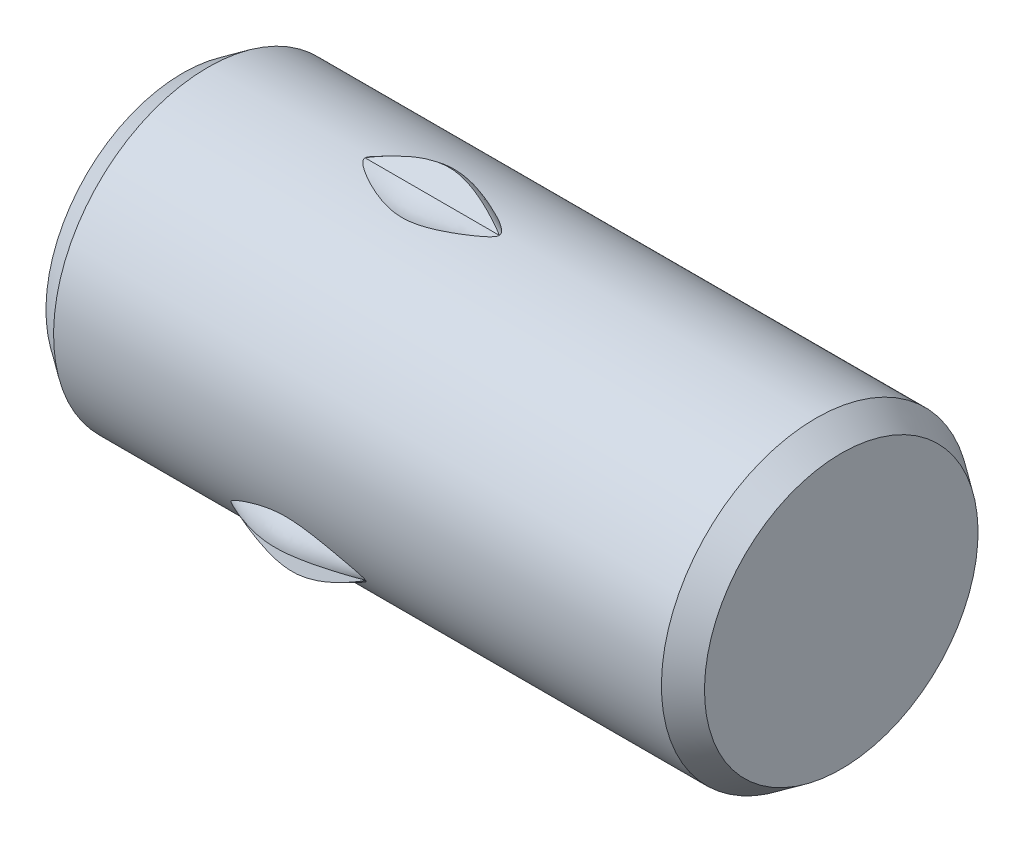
ISO-10303-21;
HEADER;
FILE_DESCRIPTION(('STEP AP214'),'2;1');
FILE_NAME('part.step','',(''),(''),'','','');
FILE_SCHEMA(('AUTOMOTIVE_DESIGN { 1 0 10303 214 1 1 1 1 }'));
ENDSEC;
DATA;
#1=APPLICATION_CONTEXT('core data for automotive mechanical design processes');
#2=APPLICATION_PROTOCOL_DEFINITION('international standard','automotive_design',2000,#1);
#3=PRODUCT_CONTEXT('',#1,'mechanical');
#4=PRODUCT('Part','Part','',(#3));
#5=PRODUCT_RELATED_PRODUCT_CATEGORY('part','',(#4));
#6=PRODUCT_DEFINITION_FORMATION('','',#4);
#7=PRODUCT_DEFINITION_CONTEXT('part definition',#1,'design');
#8=PRODUCT_DEFINITION('design','',#6,#7);
#9=PRODUCT_DEFINITION_SHAPE('','',#8);
#10=(LENGTH_UNIT() NAMED_UNIT(*) SI_UNIT(.MILLI.,.METRE.));
#11=(NAMED_UNIT(*) PLANE_ANGLE_UNIT() SI_UNIT($,.RADIAN.));
#12=(NAMED_UNIT(*) SI_UNIT($,.STERADIAN.) SOLID_ANGLE_UNIT());
#13=UNCERTAINTY_MEASURE_WITH_UNIT(LENGTH_MEASURE(1.E-05),#10,'distance_accuracy_value','');
#14=(GEOMETRIC_REPRESENTATION_CONTEXT(3) GLOBAL_UNCERTAINTY_ASSIGNED_CONTEXT((#13)) GLOBAL_UNIT_ASSIGNED_CONTEXT((#10,
#11,#12)) REPRESENTATION_CONTEXT('',''));
#15=CARTESIAN_POINT('',(0.,0.,0.));
#16=DIRECTION('',(0.,0.,1.));
#17=DIRECTION('',(1.,0.,0.));
#18=AXIS2_PLACEMENT_3D('',#15,#16,#17);
#19=CARTESIAN_POINT('',(-0.0635000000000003,-0.388870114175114,0.669991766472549));
#20=CARTESIAN_POINT('',(-0.175683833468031,-0.41758621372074,0.716876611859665));
#21=CARTESIAN_POINT('',(-0.400053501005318,-0.475018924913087,0.810647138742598));
#22=CARTESIAN_POINT('',(-0.624417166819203,-0.418041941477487,0.716583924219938));
#23=CARTESIAN_POINT('',(-0.7366,-0.389553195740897,0.669551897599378));
#24=CARTESIAN_POINT('',(-0.0635000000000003,-0.378911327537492,0.676278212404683));
#25=CARTESIAN_POINT('',(-0.175683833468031,-0.395353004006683,0.730680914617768));
#26=CARTESIAN_POINT('',(-0.400053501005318,-0.428236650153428,0.839487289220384));
#27=CARTESIAN_POINT('',(-0.624417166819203,-0.395885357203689,0.730507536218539));
#28=CARTESIAN_POINT('',(-0.7366,-0.379709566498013,0.676017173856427));
#29=CARTESIAN_POINT('',(-0.0635000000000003,-0.353634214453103,0.679154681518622));
#30=CARTESIAN_POINT('',(-0.175683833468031,-0.339517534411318,0.739162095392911));
#31=CARTESIAN_POINT('',(-0.400053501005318,-0.311283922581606,0.859177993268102));
#32=CARTESIAN_POINT('',(-0.624417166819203,-0.340086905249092,0.739292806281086));
#33=CARTESIAN_POINT('',(-0.7366,-0.354488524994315,0.679349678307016));
#34=CARTESIAN_POINT('',(-0.0635000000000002,-0.321704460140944,0.659556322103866));
#35=CARTESIAN_POINT('',(-0.175683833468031,-0.270186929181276,0.690898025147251));
#36=CARTESIAN_POINT('',(-0.400053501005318,-0.167150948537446,0.753581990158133));
#37=CARTESIAN_POINT('',(-0.624417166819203,-0.270523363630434,0.691414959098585));
#38=CARTESIAN_POINT('',(-0.7366,-0.32221003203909,0.660331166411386));
#39=CARTESIAN_POINT('',(-0.0635000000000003,-0.317825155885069,0.62122110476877));
#40=CARTESIAN_POINT('',(-0.175683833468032,-0.25774633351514,0.606871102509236));
#41=CARTESIAN_POINT('',(-0.400053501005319,-0.137587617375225,0.578170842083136));
#42=CARTESIAN_POINT('',(-0.624417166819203,-0.257621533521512,0.607438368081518));
#43=CARTESIAN_POINT('',(-0.7366,-0.317639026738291,0.622072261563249));
#44=CARTESIAN_POINT('',(-0.0635000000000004,-0.337291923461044,0.588283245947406));
#45=CARTESIAN_POINT('',(-0.175683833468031,-0.305914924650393,0.537026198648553));
#46=CARTESIAN_POINT('',(-0.400053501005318,-0.243160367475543,0.434511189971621));
#47=CARTESIAN_POINT('',(-0.624417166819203,-0.305391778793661,0.537362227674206));
#48=CARTESIAN_POINT('',(-0.7366,-0.336507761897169,0.588788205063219));
#49=CARTESIAN_POINT('',(-0.0635000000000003,-0.375400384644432,0.584876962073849));
#50=CARTESIAN_POINT('',(-0.175683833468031,-0.389891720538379,0.524830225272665));
#51=CARTESIAN_POINT('',(-0.400053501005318,-0.418874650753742,0.40473568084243));
#52=CARTESIAN_POINT('',(-0.624417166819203,-0.389323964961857,0.524707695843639));
#53=CARTESIAN_POINT('',(-0.7366,-0.374548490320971,0.584694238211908));
#54=CARTESIAN_POINT('',(-0.0635000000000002,-0.408339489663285,0.604868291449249));
#55=CARTESIAN_POINT('',(-0.175683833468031,-0.459675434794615,0.573240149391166));
#56=CARTESIAN_POINT('',(-0.400053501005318,-0.562348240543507,0.509983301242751));
#57=CARTESIAN_POINT('',(-0.624417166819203,-0.45934523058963,0.572719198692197));
#58=CARTESIAN_POINT('',(-0.7366,-0.407843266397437,0.604087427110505));
#59=CARTESIAN_POINT('',(-0.0635000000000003,-0.41229818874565,0.642123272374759));
#60=CARTESIAN_POINT('',(-0.175683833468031,-0.472181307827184,0.656795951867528));
#61=CARTESIAN_POINT('',(-0.400053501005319,-0.591948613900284,0.68614157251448));
#62=CARTESIAN_POINT('',(-0.624417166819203,-0.472299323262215,0.656223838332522));
#63=CARTESIAN_POINT('',(-0.7366,-0.412474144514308,0.641264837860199));
#64=CARTESIAN_POINT('',(-0.0635000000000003,-0.398828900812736,0.663705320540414));
#65=CARTESIAN_POINT('',(-0.175683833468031,-0.439819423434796,0.703072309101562));
#66=CARTESIAN_POINT('',(-0.400053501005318,-0.521801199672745,0.781806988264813));
#67=CARTESIAN_POINT('',(-0.624417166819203,-0.440198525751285,0.702660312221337));
#68=CARTESIAN_POINT('',(-0.7366,-0.399396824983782,0.663086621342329));
#69=CARTESIAN_POINT('',(-0.0635000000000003,-0.388870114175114,0.669991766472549));
#70=CARTESIAN_POINT('',(-0.175683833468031,-0.41758621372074,0.716876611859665));
#71=CARTESIAN_POINT('',(-0.400053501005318,-0.475018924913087,0.810647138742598));
#72=CARTESIAN_POINT('',(-0.624417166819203,-0.418041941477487,0.716583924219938));
#73=CARTESIAN_POINT('',(-0.7366,-0.389553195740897,0.669551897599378));
#74=B_SPLINE_SURFACE_WITH_KNOTS('',3,3,((#19,#20,#21,#22,#23),(#24,#25,#26,#27,#28),(#29,#30,
#31,#32,#33),(#34,#35,#36,#37,#38),(#39,#40,#41,#42,#43),(#44,#45,#46,#47,#48),(#49,#50,#51,#52,
#53),(#54,#55,#56,#57,#58),(#59,#60,#61,#62,#63),(#64,#65,#66,#67,#68),(#69,#70,#71,#72,#73)),
.UNSPECIFIED.,.T.,.F.,.F.,(4,1,1,1,1,1,1,1,4),(4,1,4),(0.,0.125,0.25,0.375,0.5,0.625,0.75,0.875,
1.),(0.,0.499995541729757,1.),.UNSPECIFIED.);
#75=CARTESIAN_POINT('',(-0.0635113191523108,-0.387605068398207,0.67076255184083));
#76=CARTESIAN_POINT('',(-0.0635157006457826,-0.385239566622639,0.672129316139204));
#77=CARTESIAN_POINT('',(-0.0641194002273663,-0.382866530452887,0.673483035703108));
#78=CARTESIAN_POINT('',(-0.0665431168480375,-0.377242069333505,0.676656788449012));
#79=CARTESIAN_POINT('',(-0.0688294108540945,-0.374167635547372,0.678357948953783));
#80=CARTESIAN_POINT('',(-0.0754986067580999,-0.366632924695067,0.682472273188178));
#81=CARTESIAN_POINT('',(-0.0803039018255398,-0.362490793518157,0.684675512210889));
#82=CARTESIAN_POINT('',(-0.090419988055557,-0.354652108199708,0.688767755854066));
#83=CARTESIAN_POINT('',(-0.095734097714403,-0.350958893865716,0.690654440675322));
#84=CARTESIAN_POINT('',(-0.107418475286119,-0.343355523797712,0.694469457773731));
#85=CARTESIAN_POINT('',(-0.113829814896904,-0.339492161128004,0.696363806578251));
#86=CARTESIAN_POINT('',(-0.126849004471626,-0.332012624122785,0.699960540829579));
#87=CARTESIAN_POINT('',(-0.133456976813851,-0.328396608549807,0.701662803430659));
#88=CARTESIAN_POINT('',(-0.153508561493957,-0.317816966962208,0.706550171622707));
#89=CARTESIAN_POINT('',(-0.167156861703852,-0.311135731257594,0.709508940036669));
#90=CARTESIAN_POINT('',(-0.194855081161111,-0.298427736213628,0.714946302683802));
#91=CARTESIAN_POINT('',(-0.208905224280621,-0.292401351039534,0.717424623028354));
#92=CARTESIAN_POINT('',(-0.237377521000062,-0.281160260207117,0.721904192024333));
#93=CARTESIAN_POINT('',(-0.251799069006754,-0.275944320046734,0.723906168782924));
#94=CARTESIAN_POINT('',(-0.287404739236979,-0.264523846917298,0.728174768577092));
#95=CARTESIAN_POINT('',(-0.308806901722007,-0.258873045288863,0.73017902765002));
#96=CARTESIAN_POINT('',(-0.3521866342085,-0.250826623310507,0.732984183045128));
#97=CARTESIAN_POINT('',(-0.374158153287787,-0.248405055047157,0.733794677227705));
#98=CARTESIAN_POINT('',(-0.418317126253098,-0.2479259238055,0.73395732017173));
#99=CARTESIAN_POINT('',(-0.440505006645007,-0.249899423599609,0.733299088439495));
#100=CARTESIAN_POINT('',(-0.484312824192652,-0.257251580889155,0.730749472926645));
#101=CARTESIAN_POINT('',(-0.505927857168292,-0.26265336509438,0.728849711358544));
#102=CARTESIAN_POINT('',(-0.546333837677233,-0.275118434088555,0.724230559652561));
#103=CARTESIAN_POINT('',(-0.565200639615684,-0.281980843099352,0.721603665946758));
#104=CARTESIAN_POINT('',(-0.602226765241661,-0.296982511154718,0.71556083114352));
#105=CARTESIAN_POINT('',(-0.620387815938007,-0.305118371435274,0.712146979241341));
#106=CARTESIAN_POINT('',(-0.647122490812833,-0.318185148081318,0.706357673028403));
#107=CARTESIAN_POINT('',(-0.655974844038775,-0.322699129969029,0.704309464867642));
#108=CARTESIAN_POINT('',(-0.673427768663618,-0.332067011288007,0.699941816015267));
#109=CARTESIAN_POINT('',(-0.68202853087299,-0.336920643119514,0.697622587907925));
#110=CARTESIAN_POINT('',(-0.695461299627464,-0.34513240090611,0.693581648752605));
#111=CARTESIAN_POINT('',(-0.700435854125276,-0.348320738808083,0.691987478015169));
#112=CARTESIAN_POINT('',(-0.710104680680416,-0.354990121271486,0.688590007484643));
#113=CARTESIAN_POINT('',(-0.714799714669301,-0.358470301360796,0.686787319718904));
#114=CARTESIAN_POINT('',(-0.722430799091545,-0.364908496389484,0.683382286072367));
#115=CARTESIAN_POINT('',(-0.72549935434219,-0.367753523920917,0.681857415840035));
#116=CARTESIAN_POINT('',(-0.731075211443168,-0.373936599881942,0.678486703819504));
#117=CARTESIAN_POINT('',(-0.733578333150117,-0.377278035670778,0.676638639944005));
#118=CARTESIAN_POINT('',(-0.735956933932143,-0.382987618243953,0.673413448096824));
#119=CARTESIAN_POINT('',(-0.736508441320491,-0.385114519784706,0.672200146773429));
#120=CARTESIAN_POINT('',(-0.736629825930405,-0.389396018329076,0.669728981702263));
#121=CARTESIAN_POINT('',(-0.736194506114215,-0.391550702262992,0.668470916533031));
#122=CARTESIAN_POINT('',(-0.734284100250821,-0.396491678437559,0.665557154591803));
#123=CARTESIAN_POINT('',(-0.732439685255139,-0.399146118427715,0.663965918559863));
#124=CARTESIAN_POINT('',(-0.727085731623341,-0.405479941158,0.660126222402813));
#125=CARTESIAN_POINT('',(-0.723223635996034,-0.408893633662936,0.658012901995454));
#126=CARTESIAN_POINT('',(-0.715065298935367,-0.41532066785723,0.653974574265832));
#127=CARTESIAN_POINT('',(-0.710766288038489,-0.418331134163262,0.652050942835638));
#128=CARTESIAN_POINT('',(-0.696180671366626,-0.427858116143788,0.645880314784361));
#129=CARTESIAN_POINT('',(-0.685422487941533,-0.4338057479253,0.641888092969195));
#130=CARTESIAN_POINT('',(-0.663450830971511,-0.445004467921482,0.634173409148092));
#131=CARTESIAN_POINT('',(-0.652236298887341,-0.450253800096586,0.630451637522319));
#132=CARTESIAN_POINT('',(-0.629464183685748,-0.460209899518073,0.623221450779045));
#133=CARTESIAN_POINT('',(-0.617905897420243,-0.464915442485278,0.619713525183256));
#134=CARTESIAN_POINT('',(-0.594533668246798,-0.473786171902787,0.61295822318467));
#135=CARTESIAN_POINT('',(-0.582720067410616,-0.477952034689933,0.609710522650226));
#136=CARTESIAN_POINT('',(-0.546760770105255,-0.489619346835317,0.600442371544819));
#137=CARTESIAN_POINT('',(-0.522171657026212,-0.496257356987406,0.594921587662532));
#138=CARTESIAN_POINT('',(-0.484603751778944,-0.503790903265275,0.588528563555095));
#139=CARTESIAN_POINT('',(-0.472025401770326,-0.505894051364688,0.58671624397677));
#140=CARTESIAN_POINT('',(-0.446663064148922,-0.509163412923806,0.583881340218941));
#141=CARTESIAN_POINT('',(-0.433879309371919,-0.510330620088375,0.582857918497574));
#142=CARTESIAN_POINT('',(-0.409782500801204,-0.511481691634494,0.581848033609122));
#143=CARTESIAN_POINT('',(-0.398480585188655,-0.511592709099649,0.581750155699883));
#144=CARTESIAN_POINT('',(-0.375921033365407,-0.510931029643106,0.582331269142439));
#145=CARTESIAN_POINT('',(-0.364663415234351,-0.51015800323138,0.583010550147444));
#146=CARTESIAN_POINT('',(-0.342206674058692,-0.507845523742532,0.585025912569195));
#147=CARTESIAN_POINT('',(-0.331008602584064,-0.506300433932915,0.586366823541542));
#148=CARTESIAN_POINT('',(-0.308808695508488,-0.502540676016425,0.589592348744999));
#149=CARTESIAN_POINT('',(-0.297806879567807,-0.500325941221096,0.591477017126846));
#150=CARTESIAN_POINT('',(-0.25811678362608,-0.491230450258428,0.599104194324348));
#151=CARTESIAN_POINT('',(-0.230049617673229,-0.482659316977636,0.606099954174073));
#152=CARTESIAN_POINT('',(-0.189129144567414,-0.467686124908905,0.617632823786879));
#153=CARTESIAN_POINT('',(-0.175693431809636,-0.462346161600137,0.621647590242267));
#154=CARTESIAN_POINT('',(-0.149226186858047,-0.450941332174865,0.629969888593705));
#155=CARTESIAN_POINT('',(-0.136194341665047,-0.444877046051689,0.634277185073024));
#156=CARTESIAN_POINT('',(-0.114374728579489,-0.433596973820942,0.642017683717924));
#157=CARTESIAN_POINT('',(-0.105428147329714,-0.428625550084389,0.645354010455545));
#158=CARTESIAN_POINT('',(-0.091109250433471,-0.419596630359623,0.651243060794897));
#159=CARTESIAN_POINT('',(-0.0855434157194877,-0.415790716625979,0.653683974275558));
#160=CARTESIAN_POINT('',(-0.0777266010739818,-0.4095026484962,0.657627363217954));
#161=CARTESIAN_POINT('',(-0.0751950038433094,-0.407293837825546,0.658998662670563));
#162=CARTESIAN_POINT('',(-0.070513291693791,-0.402593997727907,0.661880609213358));
#163=CARTESIAN_POINT('',(-0.0683606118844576,-0.400105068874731,0.663390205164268));
#164=CARTESIAN_POINT('',(-0.0653843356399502,-0.395305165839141,0.666257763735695));
#165=CARTESIAN_POINT('',(-0.0643635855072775,-0.393102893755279,0.667560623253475));
#166=CARTESIAN_POINT('',(-0.0636308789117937,-0.389751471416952,0.669518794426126));
#167=CARTESIAN_POINT('',(-0.0635093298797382,-0.388679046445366,0.670142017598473));
#168=CARTESIAN_POINT('',(-0.0635113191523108,-0.387605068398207,0.67076255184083));
#169=B_SPLINE_CURVE_WITH_KNOTS('',3,(#75,#76,#77,#78,#79,#80,#81,#82,#83,#84,#85,#86,#87,#88,
#89,#90,#91,#92,#93,#94,#95,#96,#97,#98,#99,#100,#101,#102,#103,#104,#105,#106,#107,#108,#109,
#110,#111,#112,#113,#114,#115,#116,#117,#118,#119,#120,#121,#122,#123,#124,#125,#126,#127,#128,
#129,#130,#131,#132,#133,#134,#135,#136,#137,#138,#139,#140,#141,#142,#143,#144,#145,#146,#147,
#148,#149,#150,#151,#152,#153,#154,#155,#156,#157,#158,#159,#160,#161,#162,#163,#164,#165,#166,
#167,#168),.UNSPECIFIED.,.T.,.F.,(4,2,2,2,2,2,2,2,2,2,2,2,2,2,2,2,2,2,2,2,2,2,2,2,2,2,2,2,2,2,2,
2,2,2,2,2,2,2,2,2,2,2,2,2,2,2,4),(0.,0.00818411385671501,0.0205829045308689,0.0406461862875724,
0.0608506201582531,0.0839988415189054,0.107161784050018,0.153570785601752,0.200006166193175,
0.246370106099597,0.312860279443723,0.378812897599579,0.445233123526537,0.512106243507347,
0.572769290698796,0.633273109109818,0.663704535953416,0.694112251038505,0.712467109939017,
0.730769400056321,0.744126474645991,0.757579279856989,0.76496126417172,0.772382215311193,
0.783024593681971,0.799665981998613,0.816420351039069,0.855105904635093,0.893886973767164,
0.932753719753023,0.971571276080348,1.04946263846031,1.08806122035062,1.12661876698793,
1.16046551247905,1.19432487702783,1.22843513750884,1.26254879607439,1.35267631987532,
1.39768593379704,1.44265974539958,1.4749267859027,1.49638663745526,1.50725853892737,
1.51805375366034,1.52617425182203,1.52988997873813),.UNSPECIFIED.);
#170=CARTESIAN_POINT('',(-0.736571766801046,-0.387350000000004,0.670909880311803));
#171=VERTEX_POINT('',#170);
#172=CARTESIAN_POINT('',(-0.0635135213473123,-0.387350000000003,0.670909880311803));
#173=VERTEX_POINT('',#172);
#174=EDGE_CURVE('E206',#171,#173,#169,.T.);
#175=CARTESIAN_POINT('',(-0.0635135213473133,-0.387350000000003,0.670909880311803));
#176=CARTESIAN_POINT('',(-0.0663857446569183,-0.389280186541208,0.671427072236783));
#177=CARTESIAN_POINT('',(-0.0693030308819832,-0.391144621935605,0.67192664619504));
#178=CARTESIAN_POINT('',(-0.0751996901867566,-0.394777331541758,0.672900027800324));
#179=CARTESIAN_POINT('',(-0.0781790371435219,-0.396545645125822,0.673373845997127));
#180=CARTESIAN_POINT('',(-0.0871677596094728,-0.401759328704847,0.674770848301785));
#181=CARTESIAN_POINT('',(-0.0932317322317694,-0.405115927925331,0.675670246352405));
#182=CARTESIAN_POINT('',(-0.105486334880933,-0.41171424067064,0.677438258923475));
#183=CARTESIAN_POINT('',(-0.111677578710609,-0.414954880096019,0.678306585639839));
#184=CARTESIAN_POINT('',(-0.12412341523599,-0.421324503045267,0.68001332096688));
#185=CARTESIAN_POINT('',(-0.130378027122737,-0.42445345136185,0.680851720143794));
#186=CARTESIAN_POINT('',(-0.151397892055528,-0.434751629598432,0.683611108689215));
#187=CARTESIAN_POINT('',(-0.166286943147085,-0.441690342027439,0.68547033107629));
#188=CARTESIAN_POINT('',(-0.196382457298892,-0.454889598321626,0.689007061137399));
#189=CARTESIAN_POINT('',(-0.211589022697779,-0.46114991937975,0.690684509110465));
#190=CARTESIAN_POINT('',(-0.257644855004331,-0.478516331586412,0.695337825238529));
#191=CARTESIAN_POINT('',(-0.28909274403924,-0.488292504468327,0.697957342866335));
#192=CARTESIAN_POINT('',(-0.343875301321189,-0.499311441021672,0.700909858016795));
#193=CARTESIAN_POINT('',(-0.366809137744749,-0.502235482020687,0.701693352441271));
#194=CARTESIAN_POINT('',(-0.401297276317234,-0.503222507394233,0.701957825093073));
#195=CARTESIAN_POINT('',(-0.412802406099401,-0.502985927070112,0.701894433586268));
#196=CARTESIAN_POINT('',(-0.4357388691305,-0.501444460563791,0.70148139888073));
#197=CARTESIAN_POINT('',(-0.447170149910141,-0.500138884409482,0.701131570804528));
#198=CARTESIAN_POINT('',(-0.474621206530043,-0.495893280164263,0.699993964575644));
#199=CARTESIAN_POINT('',(-0.490564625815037,-0.492498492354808,0.699084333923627));
#200=CARTESIAN_POINT('',(-0.522057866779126,-0.484314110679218,0.696891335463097));
#201=CARTESIAN_POINT('',(-0.537607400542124,-0.479523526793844,0.695607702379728));
#202=CARTESIAN_POINT('',(-0.583930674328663,-0.463551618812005,0.691328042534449));
#203=CARTESIAN_POINT('',(-0.614127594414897,-0.450821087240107,0.687916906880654));
#204=CARTESIAN_POINT('',(-0.651732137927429,-0.433222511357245,0.68320138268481));
#205=CARTESIAN_POINT('',(-0.659706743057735,-0.429387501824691,0.682173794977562));
#206=CARTESIAN_POINT('',(-0.675565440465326,-0.421548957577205,0.680073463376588));
#207=CARTESIAN_POINT('',(-0.683449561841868,-0.417545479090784,0.679000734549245));
#208=CARTESIAN_POINT('',(-0.699007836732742,-0.409400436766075,0.676818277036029));
#209=CARTESIAN_POINT('',(-0.70668338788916,-0.405261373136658,0.675709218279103));
#210=CARTESIAN_POINT('',(-0.71805811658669,-0.398815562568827,0.673982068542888));
#211=CARTESIAN_POINT('',(-0.721827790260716,-0.396626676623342,0.673395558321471));
#212=CARTESIAN_POINT('',(-0.729278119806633,-0.392108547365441,0.672184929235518));
#213=CARTESIAN_POINT('',(-0.73295872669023,-0.38977922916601,0.671560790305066));
#214=CARTESIAN_POINT('',(-0.736571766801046,-0.387350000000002,0.670909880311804));
#215=B_SPLINE_CURVE_WITH_KNOTS('',3,(#175,#176,#177,#178,#179,#180,#181,#182,#183,#184,#185,
#186,#187,#188,#189,#190,#191,#192,#193,#194,#195,#196,#197,#198,#199,#200,#201,#202,#203,#204,
#205,#206,#207,#208,#209,#210,#211,#212,#213,#214),.UNSPECIFIED.,.F.,.F.,(4,2,2,2,2,2,2,2,2,2,2,
2,2,2,2,2,2,2,2,4),(0.,0.0104932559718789,0.0209821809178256,0.0419459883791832,
0.0630700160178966,0.0842006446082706,0.133772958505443,0.183361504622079,0.281986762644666,
0.350983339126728,0.385448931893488,0.41993678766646,0.468819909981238,0.517737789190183,
0.616336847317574,0.643063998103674,0.669782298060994,0.696150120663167,0.709342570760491,
0.722542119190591),.UNSPECIFIED.);
#216=EDGE_CURVE('E12',#173,#171,#215,.T.);
#217=CARTESIAN_POINT('',(-0.0635000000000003,-0.321716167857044,0.622120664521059));
#218=CARTESIAN_POINT('',(-0.175683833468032,-0.267847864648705,0.609234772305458));
#219=CARTESIAN_POINT('',(-0.400053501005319,-0.160110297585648,0.58346275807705));
#220=CARTESIAN_POINT('',(-0.624417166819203,-0.267733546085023,0.609755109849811));
#221=CARTESIAN_POINT('',(-0.7366,-0.321545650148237,0.6229014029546));
#222=CARTESIAN_POINT('',(-0.0635000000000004,-0.324314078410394,0.610241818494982));
#223=CARTESIAN_POINT('',(-0.175683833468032,-0.273802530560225,0.583589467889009));
#224=CARTESIAN_POINT('',(-0.400053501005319,-0.172778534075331,0.530284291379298));
#225=CARTESIAN_POINT('',(-0.624417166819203,-0.273544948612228,0.584079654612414));
#226=CARTESIAN_POINT('',(-0.7366,-0.323928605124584,0.610977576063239));
#227=CARTESIAN_POINT('',(-0.0635000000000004,-0.337291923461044,0.588283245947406));
#228=CARTESIAN_POINT('',(-0.175683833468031,-0.305914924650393,0.537026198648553));
#229=CARTESIAN_POINT('',(-0.400053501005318,-0.243160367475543,0.434511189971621));
#230=CARTESIAN_POINT('',(-0.624417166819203,-0.305391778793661,0.537362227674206));
#231=CARTESIAN_POINT('',(-0.7366,-0.336507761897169,0.588788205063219));
#232=CARTESIAN_POINT('',(-0.0635000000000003,-0.375400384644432,0.584876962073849));
#233=CARTESIAN_POINT('',(-0.175683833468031,-0.389891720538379,0.524830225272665));
#234=CARTESIAN_POINT('',(-0.400053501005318,-0.418874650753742,0.40473568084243));
#235=CARTESIAN_POINT('',(-0.624417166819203,-0.389323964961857,0.524707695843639));
#236=CARTESIAN_POINT('',(-0.7366,-0.374548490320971,0.584694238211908));
#237=CARTESIAN_POINT('',(-0.0635000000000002,-0.408339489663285,0.604868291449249));
#238=CARTESIAN_POINT('',(-0.175683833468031,-0.459675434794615,0.573240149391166));
#239=CARTESIAN_POINT('',(-0.400053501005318,-0.562348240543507,0.509983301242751));
#240=CARTESIAN_POINT('',(-0.624417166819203,-0.45934523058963,0.572719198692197));
#241=CARTESIAN_POINT('',(-0.7366,-0.407843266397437,0.604087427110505));
#242=CARTESIAN_POINT('',(-0.0635000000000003,-0.41229818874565,0.642123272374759));
#243=CARTESIAN_POINT('',(-0.175683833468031,-0.472181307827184,0.656795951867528));
#244=CARTESIAN_POINT('',(-0.400053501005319,-0.591948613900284,0.68614157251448));
#245=CARTESIAN_POINT('',(-0.624417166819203,-0.472299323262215,0.656223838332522));
#246=CARTESIAN_POINT('',(-0.7366,-0.412474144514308,0.641264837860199));
#247=CARTESIAN_POINT('',(-0.0635000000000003,-0.398828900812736,0.663705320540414));
#248=CARTESIAN_POINT('',(-0.175683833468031,-0.439819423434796,0.703072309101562));
#249=CARTESIAN_POINT('',(-0.400053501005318,-0.521801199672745,0.781806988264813));
#250=CARTESIAN_POINT('',(-0.624417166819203,-0.440198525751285,0.702660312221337));
#251=CARTESIAN_POINT('',(-0.7366,-0.399396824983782,0.663086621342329));
#252=CARTESIAN_POINT('',(-0.0635000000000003,-0.378911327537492,0.676278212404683));
#253=CARTESIAN_POINT('',(-0.175683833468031,-0.395353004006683,0.730680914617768));
#254=CARTESIAN_POINT('',(-0.400053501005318,-0.428236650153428,0.839487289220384));
#255=CARTESIAN_POINT('',(-0.624417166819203,-0.395885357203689,0.730507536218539));
#256=CARTESIAN_POINT('',(-0.7366,-0.379709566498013,0.676017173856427));
#257=CARTESIAN_POINT('',(-0.0635000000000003,-0.353634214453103,0.679154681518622));
#258=CARTESIAN_POINT('',(-0.175683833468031,-0.339517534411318,0.739162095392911));
#259=CARTESIAN_POINT('',(-0.400053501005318,-0.311283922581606,0.859177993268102));
#260=CARTESIAN_POINT('',(-0.624417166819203,-0.340086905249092,0.739292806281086));
#261=CARTESIAN_POINT('',(-0.7366,-0.354488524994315,0.679349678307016));
#262=CARTESIAN_POINT('',(-0.0635000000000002,-0.321704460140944,0.659556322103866));
#263=CARTESIAN_POINT('',(-0.175683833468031,-0.270186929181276,0.690898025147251));
#264=CARTESIAN_POINT('',(-0.400053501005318,-0.167150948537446,0.753581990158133));
#265=CARTESIAN_POINT('',(-0.624417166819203,-0.270523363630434,0.691414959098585));
#266=CARTESIAN_POINT('',(-0.7366,-0.32221003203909,0.660331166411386));
#267=CARTESIAN_POINT('',(-0.0635000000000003,-0.319118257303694,0.633999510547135));
#268=CARTESIAN_POINT('',(-0.175683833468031,-0.261893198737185,0.634880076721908));
#269=CARTESIAN_POINT('',(-0.400053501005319,-0.147442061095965,0.636641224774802));
#270=CARTESIAN_POINT('',(-0.624417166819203,-0.261922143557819,0.635430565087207));
#271=CARTESIAN_POINT('',(-0.7366,-0.319162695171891,0.634825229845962));
#272=CARTESIAN_POINT('',(-0.0635000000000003,-0.321716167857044,0.622120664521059));
#273=CARTESIAN_POINT('',(-0.175683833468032,-0.267847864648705,0.609234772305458));
#274=CARTESIAN_POINT('',(-0.400053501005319,-0.160110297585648,0.58346275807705));
#275=CARTESIAN_POINT('',(-0.624417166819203,-0.267733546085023,0.609755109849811));
#276=CARTESIAN_POINT('',(-0.7366,-0.321545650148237,0.6229014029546));
#277=B_SPLINE_SURFACE_WITH_KNOTS('',3,3,((#217,#218,#219,#220,#221),(#222,#223,#224,#225,#226),
(#227,#228,#229,#230,#231),(#232,#233,#234,#235,#236),(#237,#238,#239,#240,#241),(#242,#243,
#244,#245,#246),(#247,#248,#249,#250,#251),(#252,#253,#254,#255,#256),(#257,#258,#259,#260,
#261),(#262,#263,#264,#265,#266),(#267,#268,#269,#270,#271),(#272,#273,#274,#275,#276)),
.UNSPECIFIED.,.T.,.F.,.F.,(4,1,1,1,1,2,1,1,4),(4,1,4),(0.375,0.5,0.625,0.75,0.875,1.,1.125,1.25,
1.375),(0.,0.499995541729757,1.),.UNSPECIFIED.);
#278=ORIENTED_EDGE('',*,*,#174,.T.);
#279=ORIENTED_EDGE('',*,*,#216,.T.);
#280=EDGE_LOOP('',(#278,#279));
#281=FACE_BOUND('',#280,.T.);
#282=ADVANCED_FACE('F75',(#281),#277,.T.);
#283=EDGE_CURVE('E135',#173,#171,#169,.T.);
#284=CARTESIAN_POINT('',(-0.736571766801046,-0.387350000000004,0.670909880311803));
#285=CARTESIAN_POINT('',(-0.730777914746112,-0.386337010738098,0.674690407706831));
#286=CARTESIAN_POINT('',(-0.72486536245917,-0.385373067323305,0.678287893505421));
#287=CARTESIAN_POINT('',(-0.712889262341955,-0.383511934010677,0.685233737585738));
#288=CARTESIAN_POINT('',(-0.706825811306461,-0.38261470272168,0.68858225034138));
#289=CARTESIAN_POINT('',(-0.694579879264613,-0.380847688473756,0.695176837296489));
#290=CARTESIAN_POINT('',(-0.688396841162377,-0.379978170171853,0.698421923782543));
#291=CARTESIAN_POINT('',(-0.675966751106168,-0.378269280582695,0.704799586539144));
#292=CARTESIAN_POINT('',(-0.669719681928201,-0.377429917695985,0.707932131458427));
#293=CARTESIAN_POINT('',(-0.648703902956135,-0.374664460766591,0.718252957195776));
#294=CARTESIAN_POINT('',(-0.633810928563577,-0.372800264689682,0.725210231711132));
#295=CARTESIAN_POINT('',(-0.603704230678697,-0.369255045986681,0.738441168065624));
#296=CARTESIAN_POINT('',(-0.588490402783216,-0.367574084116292,0.744714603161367));
#297=CARTESIAN_POINT('',(-0.542412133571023,-0.362912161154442,0.762113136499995));
#298=CARTESIAN_POINT('',(-0.510945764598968,-0.360289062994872,0.771902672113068));
#299=CARTESIAN_POINT('',(-0.456156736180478,-0.357336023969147,0.782923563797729));
#300=CARTESIAN_POINT('',(-0.433236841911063,-0.356553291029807,0.785844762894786));
#301=CARTESIAN_POINT('',(-0.398769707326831,-0.356289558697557,0.786829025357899));
#302=CARTESIAN_POINT('',(-0.387271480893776,-0.356353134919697,0.786591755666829));
#303=CARTESIAN_POINT('',(-0.364348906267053,-0.356766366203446,0.785049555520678));
#304=CARTESIAN_POINT('',(-0.352924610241,-0.357116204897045,0.783743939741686));
#305=CARTESIAN_POINT('',(-0.325514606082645,-0.358252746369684,0.779502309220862));
#306=CARTESIAN_POINT('',(-0.30960481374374,-0.35916053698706,0.776114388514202));
#307=CARTESIAN_POINT('',(-0.278177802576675,-0.361349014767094,0.767946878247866));
#308=CARTESIAN_POINT('',(-0.262660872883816,-0.362629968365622,0.763166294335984));
#309=CARTESIAN_POINT('',(-0.216434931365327,-0.366901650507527,0.747224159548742));
#310=CARTESIAN_POINT('',(-0.186302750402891,-0.370307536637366,0.734513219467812));
#311=CARTESIAN_POINT('',(-0.148736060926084,-0.375024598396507,0.716908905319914));
#312=CARTESIAN_POINT('',(-0.140731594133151,-0.376057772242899,0.713053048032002));
#313=CARTESIAN_POINT('',(-0.124813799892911,-0.378169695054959,0.705171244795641));
#314=CARTESIAN_POINT('',(-0.116900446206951,-0.379248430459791,0.701145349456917));
#315=CARTESIAN_POINT('',(-0.101283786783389,-0.38144209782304,0.692958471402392));
#316=CARTESIAN_POINT('',(-0.0935790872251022,-0.382556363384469,0.688799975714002));
#317=CARTESIAN_POINT('',(-0.0821524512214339,-0.384287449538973,0.682339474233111));
#318=CARTESIAN_POINT('',(-0.0783642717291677,-0.384874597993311,0.680148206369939));
#319=CARTESIAN_POINT('',(-0.0708684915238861,-0.386083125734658,0.675637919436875));
#320=CARTESIAN_POINT('',(-0.0671609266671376,-0.386704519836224,0.673318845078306));
#321=CARTESIAN_POINT('',(-0.0635135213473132,-0.387350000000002,0.670909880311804));
#322=B_SPLINE_CURVE_WITH_KNOTS('',3,(#284,#285,#286,#287,#288,#289,#290,#291,#292,#293,#294,
#295,#296,#297,#298,#299,#300,#301,#302,#303,#304,#305,#306,#307,#308,#309,#310,#311,#312,#313,
#314,#315,#316,#317,#318,#319,#320,#321),.UNSPECIFIED.,.F.,.F.,(4,2,2,2,2,2,2,2,2,2,2,2,2,2,2,2,
2,2,4),(0.,0.0209614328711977,0.0419097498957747,0.0630194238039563,0.0841349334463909,
0.133742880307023,0.183367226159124,0.282054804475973,0.351008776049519,0.385453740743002,
0.419920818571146,0.468701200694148,0.517516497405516,0.61591182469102,0.642748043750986,
0.669576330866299,0.696050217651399,0.709294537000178,0.722544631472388),.UNSPECIFIED.);
#323=EDGE_CURVE('E89',#171,#173,#322,.T.);
#324=ORIENTED_EDGE('',*,*,#283,.T.);
#325=ORIENTED_EDGE('',*,*,#323,.T.);
#326=EDGE_LOOP('',(#324,#325));
#327=FACE_BOUND('',#326,.T.);
#328=ADVANCED_FACE('F161',(#327),#74,.T.);
#329=CARTESIAN_POINT('',(-0.0635000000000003,-0.385794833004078,-0.67176728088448));
#330=CARTESIAN_POINT('',(-0.175683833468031,-0.412040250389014,-0.720078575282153));
#331=CARTESIAN_POINT('',(-0.400053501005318,-0.464531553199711,-0.816702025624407));
#332=CARTESIAN_POINT('',(-0.624417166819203,-0.411558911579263,-0.720326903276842));
#333=CARTESIAN_POINT('',(-0.7366,-0.385072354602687,-0.672138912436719));
#334=CARTESIAN_POINT('',(-0.0635000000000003,-0.396218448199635,-0.666285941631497));
#335=CARTESIAN_POINT('',(-0.175683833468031,-0.435111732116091,-0.707726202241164));
#336=CARTESIAN_POINT('',(-0.400053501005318,-0.512898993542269,-0.790607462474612));
#337=CARTESIAN_POINT('',(-0.624417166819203,-0.434695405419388,-0.708100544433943));
#338=CARTESIAN_POINT('',(-0.7366,-0.395593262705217,-0.66684671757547));
#339=CARTESIAN_POINT('',(-0.0635000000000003,-0.411348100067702,-0.645833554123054));
#340=CARTESIAN_POINT('',(-0.175683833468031,-0.470374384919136,-0.663611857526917));
#341=CARTESIAN_POINT('',(-0.400053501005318,-0.588428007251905,-0.699168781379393));
#342=CARTESIAN_POINT('',(-0.624417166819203,-0.470202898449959,-0.66417030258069));
#343=CARTESIAN_POINT('',(-0.7366,-0.411089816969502,-0.646670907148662));
#344=CARTESIAN_POINT('',(-0.0635000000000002,-0.410340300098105,-0.608382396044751));
#345=CARTESIAN_POINT('',(-0.175683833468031,-0.463241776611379,-0.57943775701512));
#346=CARTESIAN_POINT('',(-0.400053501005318,-0.569045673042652,-0.521547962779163));
#347=CARTESIAN_POINT('',(-0.624417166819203,-0.463521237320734,-0.579987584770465));
#348=CARTESIAN_POINT('',(-0.7366,-0.410758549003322,-0.609207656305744));
#349=CARTESIAN_POINT('',(-0.0635000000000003,-0.379080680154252,-0.585855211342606));
#350=CARTESIAN_POINT('',(-0.175683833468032,-0.396692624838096,-0.526650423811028));
#351=CARTESIAN_POINT('',(-0.400053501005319,-0.431916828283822,-0.408239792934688));
#352=CARTESIAN_POINT('',(-0.624417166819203,-0.397246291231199,-0.526825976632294));
#353=CARTESIAN_POINT('',(-0.7366,-0.379910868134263,-0.586119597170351));
#354=CARTESIAN_POINT('',(-0.0635000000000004,-0.340822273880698,-0.586244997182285));
#355=CARTESIAN_POINT('',(-0.175683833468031,-0.312120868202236,-0.533443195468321));
#356=CARTESIAN_POINT('',(-0.400053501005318,-0.254717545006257,-0.427838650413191));
#357=CARTESIAN_POINT('',(-0.624417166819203,-0.312673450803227,-0.533158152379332));
#358=CARTESIAN_POINT('',(-0.7366,-0.341651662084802,-0.585818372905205));
#359=CARTESIAN_POINT('',(-0.0635000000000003,-0.318818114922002,-0.617544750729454));
#360=CARTESIAN_POINT('',(-0.175683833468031,-0.259570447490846,-0.600071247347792));
#361=CARTESIAN_POINT('',(-0.400053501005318,-0.141074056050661,-0.565123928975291));
#362=CARTESIAN_POINT('',(-0.624417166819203,-0.259748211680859,-0.599518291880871));
#363=CARTESIAN_POINT('',(-0.7366,-0.319085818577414,-0.616715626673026));
#364=CARTESIAN_POINT('',(-0.0635000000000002,-0.319661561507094,-0.656066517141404));
#365=CARTESIAN_POINT('',(-0.175683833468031,-0.266602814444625,-0.684710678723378));
#366=CARTESIAN_POINT('',(-0.400053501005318,-0.160484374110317,-0.741999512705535));
#367=CARTESIAN_POINT('',(-0.624417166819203,-0.266316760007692,-0.68416423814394));
#368=CARTESIAN_POINT('',(-0.7366,-0.319233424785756,-0.655246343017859));
#369=CARTESIAN_POINT('',(-0.0635000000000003,-0.349945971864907,-0.678122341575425));
#370=CARTESIAN_POINT('',(-0.175683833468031,-0.332711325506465,-0.737318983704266));
#371=CARTESIAN_POINT('',(-0.400053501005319,-0.298241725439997,-0.855713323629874));
#372=CARTESIAN_POINT('',(-0.624417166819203,-0.332156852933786,-0.737135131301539));
#373=CARTESIAN_POINT('',(-0.7366,-0.349114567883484,-0.677845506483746));
#374=CARTESIAN_POINT('',(-0.0635000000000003,-0.375371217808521,-0.677248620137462));
#375=CARTESIAN_POINT('',(-0.175683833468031,-0.388968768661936,-0.732430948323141));
#376=CARTESIAN_POINT('',(-0.400053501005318,-0.416164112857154,-0.842796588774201));
#377=CARTESIAN_POINT('',(-0.624417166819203,-0.388422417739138,-0.732553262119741));
#378=CARTESIAN_POINT('',(-0.7366,-0.374551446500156,-0.677431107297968));
#379=CARTESIAN_POINT('',(-0.0635000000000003,-0.385794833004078,-0.67176728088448));
#380=CARTESIAN_POINT('',(-0.175683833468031,-0.412040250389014,-0.720078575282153));
#381=CARTESIAN_POINT('',(-0.400053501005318,-0.464531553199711,-0.816702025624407));
#382=CARTESIAN_POINT('',(-0.624417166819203,-0.411558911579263,-0.720326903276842));
#383=CARTESIAN_POINT('',(-0.7366,-0.385072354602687,-0.672138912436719));
#384=B_SPLINE_SURFACE_WITH_KNOTS('',3,3,((#329,#330,#331,#332,#333),(#334,#335,#336,#337,#338),
(#339,#340,#341,#342,#343),(#344,#345,#346,#347,#348),(#349,#350,#351,#352,#353),(#354,#355,
#356,#357,#358),(#359,#360,#361,#362,#363),(#364,#365,#366,#367,#368),(#369,#370,#371,#372,
#373),(#374,#375,#376,#377,#378),(#379,#380,#381,#382,#383)),.UNSPECIFIED.,.T.,.F.,.F.,(4,1,1,1,
1,1,1,1,4),(4,1,4),(0.,0.125,0.25,0.375,0.5,0.625,0.75,0.875,1.),(0.,0.499995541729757,1.),.UNSPECIFIED.);
#385=CARTESIAN_POINT('',(-0.06351131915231,-0.387094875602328,-0.671057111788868));
#386=CARTESIAN_POINT('',(-0.0635157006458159,-0.389461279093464,-0.669691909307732));
#387=CARTESIAN_POINT('',(-0.0641194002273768,-0.391820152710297,-0.668313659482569));
#388=CARTESIAN_POINT('',(-0.0665431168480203,-0.397380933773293,-0.665029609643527));
#389=CARTESIAN_POINT('',(-0.0688294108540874,-0.400391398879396,-0.663217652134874));
#390=CARTESIAN_POINT('',(-0.0754986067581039,-0.407721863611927,-0.658749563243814));
#391=CARTESIAN_POINT('',(-0.0803039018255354,-0.411700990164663,-0.656263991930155));
#392=CARTESIAN_POINT('',(-0.0904199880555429,-0.419164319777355,-0.651521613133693));
#393=CARTESIAN_POINT('',(-0.0957340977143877,-0.422644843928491,-0.649266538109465));
#394=CARTESIAN_POINT('',(-0.107418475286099,-0.429750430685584,-0.644589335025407));
#395=CARTESIAN_POINT('',(-0.11382981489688,-0.43332266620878,-0.642190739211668));
#396=CARTESIAN_POINT('',(-0.126849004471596,-0.4401772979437,-0.637511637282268));
#397=CARTESIAN_POINT('',(-0.133456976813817,-0.443459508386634,-0.63523120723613));
#398=CARTESIAN_POINT('',(-0.153508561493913,-0.452981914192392,-0.628512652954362));
#399=CARTESIAN_POINT('',(-0.1671568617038,-0.458884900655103,-0.624205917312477));
#400=CARTESIAN_POINT('',(-0.194855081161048,-0.469947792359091,-0.615919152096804));
#401=CARTESIAN_POINT('',(-0.208905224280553,-0.475107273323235,-0.611939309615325));
#402=CARTESIAN_POINT('',(-0.237377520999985,-0.484607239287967,-0.604444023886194));
#403=CARTESIAN_POINT('',(-0.251799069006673,-0.488948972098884,-0.600927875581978));
#404=CARTESIAN_POINT('',(-0.287404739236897,-0.498355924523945,-0.59317175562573));
#405=CARTESIAN_POINT('',(-0.308806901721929,-0.502917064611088,-0.58928014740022));
#406=CARTESIAN_POINT('',(-0.352186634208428,-0.509369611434,-0.583714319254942));
#407=CARTESIAN_POINT('',(-0.374158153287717,-0.511282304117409,-0.582022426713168));
#408=CARTESIAN_POINT('',(-0.418317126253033,-0.511662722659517,-0.581688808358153));
#409=CARTESIAN_POINT('',(-0.440505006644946,-0.510105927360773,-0.583068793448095));
#410=CARTESIAN_POINT('',(-0.4843128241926,-0.504221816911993,-0.588161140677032));
#411=CARTESIAN_POINT('',(-0.505927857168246,-0.499875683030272,-0.591889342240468));
#412=CARTESIAN_POINT('',(-0.546333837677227,-0.489642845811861,-0.600374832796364));
#413=CARTESIAN_POINT('',(-0.56520063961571,-0.483936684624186,-0.60500440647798));
#414=CARTESIAN_POINT('',(-0.602226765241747,-0.471202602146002,-0.614974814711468));
#415=CARTESIAN_POINT('',(-0.62038781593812,-0.464178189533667,-0.62031375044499));
#416=CARTESIAN_POINT('',(-0.647122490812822,-0.45263111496,-0.628735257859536));
#417=CARTESIAN_POINT('',(-0.655974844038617,-0.448600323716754,-0.631620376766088));
#418=CARTESIAN_POINT('',(-0.673427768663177,-0.440133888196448,-0.63754937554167));
#419=CARTESIAN_POINT('',(-0.68202853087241,-0.435698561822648,-0.640593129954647));
#420=CARTESIAN_POINT('',(-0.695461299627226,-0.428093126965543,-0.645684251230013));
#421=CARTESIAN_POINT('',(-0.700435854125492,-0.425118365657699,-0.64764834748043));
#422=CARTESIAN_POINT('',(-0.710104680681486,-0.418841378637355,-0.651725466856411));
#423=CARTESIAN_POINT('',(-0.71479971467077,-0.415540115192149,-0.653838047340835));
#424=CARTESIAN_POINT('',(-0.722430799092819,-0.409372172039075,-0.657711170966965));
#425=CARTESIAN_POINT('',(-0.725499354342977,-0.406629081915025,-0.659412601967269));
#426=CARTESIAN_POINT('',(-0.731075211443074,-0.400618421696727,-0.663081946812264));
#427=CARTESIAN_POINT('',(-0.733578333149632,-0.397347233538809,-0.665051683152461));
#428=CARTESIAN_POINT('',(-0.73595693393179,-0.391699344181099,-0.668383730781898));
#429=CARTESIAN_POINT('',(-0.736508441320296,-0.389585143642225,-0.66961903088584));
#430=CARTESIAN_POINT('',(-0.736629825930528,-0.385304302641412,-0.672091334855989));
#431=CARTESIAN_POINT('',(-0.736194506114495,-0.383137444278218,-0.673328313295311));
#432=CARTESIAN_POINT('',(-0.734284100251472,-0.378143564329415,-0.676150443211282));
#433=CARTESIAN_POINT('',(-0.732439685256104,-0.375438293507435,-0.677653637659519));
#434=CARTESIAN_POINT('',(-0.72708573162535,-0.368946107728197,-0.68121904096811));
#435=CARTESIAN_POINT('',(-0.723223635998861,-0.365409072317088,-0.683118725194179));
#436=CARTESIAN_POINT('',(-0.715065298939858,-0.358698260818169,-0.686665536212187));
#437=CARTESIAN_POINT('',(-0.710766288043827,-0.355527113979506,-0.688310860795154));
#438=CARTESIAN_POINT('',(-0.696180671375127,-0.345419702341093,-0.693476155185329));
#439=CARTESIAN_POINT('',(-0.685422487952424,-0.338988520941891,-0.696630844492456));
#440=CARTESIAN_POINT('',(-0.663450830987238,-0.326708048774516,-0.702471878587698));
#441=CARTESIAN_POINT('',(-0.652236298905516,-0.320860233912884,-0.705157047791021));
#442=CARTESIAN_POINT('',(-0.629464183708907,-0.30962065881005,-0.710164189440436));
#443=CARTESIAN_POINT('',(-0.61790589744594,-0.304229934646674,-0.712485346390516));
#444=CARTESIAN_POINT('',(-0.594533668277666,-0.29394430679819,-0.716789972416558));
#445=CARTESIAN_POINT('',(-0.582720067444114,-0.289048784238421,-0.718773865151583));
#446=CARTESIAN_POINT('',(-0.546760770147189,-0.275188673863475,-0.724243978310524));
#447=CARTESIAN_POINT('',(-0.522171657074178,-0.267088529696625,-0.72723227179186));
#448=CARTESIAN_POINT('',(-0.484603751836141,-0.257785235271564,-0.730560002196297));
#449=CARTESIAN_POINT('',(-0.472025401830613,-0.255164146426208,-0.731475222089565));
#450=CARTESIAN_POINT('',(-0.446663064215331,-0.251074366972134,-0.732889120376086));
#451=CARTESIAN_POINT('',(-0.43387930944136,-0.249604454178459,-0.733388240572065));
#452=CARTESIAN_POINT('',(-0.409782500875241,-0.248154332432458,-0.733880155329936));
#453=CARTESIAN_POINT('',(-0.398480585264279,-0.248014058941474,-0.733927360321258));
#454=CARTESIAN_POINT('',(-0.375921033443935,-0.248848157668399,-0.733644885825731));
#455=CARTESIAN_POINT('',(-0.364663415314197,-0.249822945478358,-0.733315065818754));
#456=CARTESIAN_POINT('',(-0.342206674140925,-0.252724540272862,-0.732320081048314));
#457=CARTESIAN_POINT('',(-0.331008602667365,-0.2546583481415,-0.731652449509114));
#458=CARTESIAN_POINT('',(-0.308808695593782,-0.259331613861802,-0.730009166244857));
#459=CARTESIAN_POINT('',(-0.297806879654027,-0.262071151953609,-0.729033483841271));
#460=CARTESIAN_POINT('',(-0.258116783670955,-0.273224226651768,-0.724970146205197));
#461=CARTESIAN_POINT('',(-0.230049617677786,-0.283568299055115,-0.721045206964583));
#462=CARTESIAN_POINT('',(-0.18912914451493,-0.301042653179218,-0.713844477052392));
#463=CARTESIAN_POINT('',(-0.175693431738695,-0.307189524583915,-0.711227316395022));
#464=CARTESIAN_POINT('',(-0.149226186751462,-0.320099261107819,-0.705511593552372));
#465=CARTESIAN_POINT('',(-0.136194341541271,-0.326861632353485,-0.702413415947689));
#466=CARTESIAN_POINT('',(-0.114374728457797,-0.339205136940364,-0.696514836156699));
#467=CARTESIAN_POINT('',(-0.105428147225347,-0.34458019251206,-0.69387762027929));
#468=CARTESIAN_POINT('',(-0.0911092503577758,-0.354194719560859,-0.689002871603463));
#469=CARTESIAN_POINT('',(-0.0855434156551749,-0.358211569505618,-0.686927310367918));
#470=CARTESIAN_POINT('',(-0.077726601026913,-0.364770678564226,-0.683453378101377));
#471=CARTESIAN_POINT('',(-0.0751950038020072,-0.367062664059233,-0.682226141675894));
#472=CARTESIAN_POINT('',(-0.0705132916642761,-0.371908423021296,-0.679596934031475));
#473=CARTESIAN_POINT('',(-0.0683606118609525,-0.374460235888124,-0.678196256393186));
#474=CARTESIAN_POINT('',(-0.0653843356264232,-0.379343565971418,-0.675473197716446));
#475=CARTESIAN_POINT('',(-0.0643635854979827,-0.381573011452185,-0.674217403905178));
#476=CARTESIAN_POINT('',(-0.0636308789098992,-0.384944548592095,-0.672294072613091));
#477=CARTESIAN_POINT('',(-0.0635093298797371,-0.386020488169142,-0.67167693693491));
#478=CARTESIAN_POINT('',(-0.06351131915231,-0.387094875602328,-0.671057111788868));
#479=B_SPLINE_CURVE_WITH_KNOTS('',3,(#385,#386,#387,#388,#389,#390,#391,#392,#393,#394,#395,
#396,#397,#398,#399,#400,#401,#402,#403,#404,#405,#406,#407,#408,#409,#410,#411,#412,#413,#414,
#415,#416,#417,#418,#419,#420,#421,#422,#423,#424,#425,#426,#427,#428,#429,#430,#431,#432,#433,
#434,#435,#436,#437,#438,#439,#440,#441,#442,#443,#444,#445,#446,#447,#448,#449,#450,#451,#452,
#453,#454,#455,#456,#457,#458,#459,#460,#461,#462,#463,#464,#465,#466,#467,#468,#469,#470,#471,
#472,#473,#474,#475,#476,#477,#478),.UNSPECIFIED.,.T.,.F.,(4,2,2,2,2,2,2,2,2,2,2,2,2,2,2,2,2,2,
2,2,2,2,2,2,2,2,2,2,2,2,2,2,2,2,2,2,2,2,2,2,2,2,2,2,2,2,4),(0.,0.00818411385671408,
0.0205829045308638,0.0406461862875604,0.0608506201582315,0.0839988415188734,0.107161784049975,
0.153570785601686,0.200006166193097,0.246370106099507,0.312860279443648,0.378812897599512,
0.445233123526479,0.512106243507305,0.572769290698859,0.633273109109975,0.663704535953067,
0.694112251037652,0.712467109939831,0.730769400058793,0.744126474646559,0.757579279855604,
0.764961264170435,0.772382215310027,0.783024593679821,0.799665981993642,0.816420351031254,
0.855105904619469,0.893886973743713,0.93275371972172,0.971571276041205,1.04946263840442,
1.08806122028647,1.12661876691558,1.16046551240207,1.19432487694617,1.22843513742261,
1.26254879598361,1.35267631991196,1.3976859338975,1.44265974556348,1.47492678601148,
1.4963866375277,1.50725853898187,1.51805375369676,1.52617425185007,1.52988997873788),.UNSPECIFIED.);
#480=CARTESIAN_POINT('',(-0.736571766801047,-0.387349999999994,-0.670909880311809));
#481=VERTEX_POINT('',#480);
#482=CARTESIAN_POINT('',(-0.0635135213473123,-0.387349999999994,-0.670909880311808));
#483=VERTEX_POINT('',#482);
#484=EDGE_CURVE('E129',#481,#483,#479,.T.);
#485=CARTESIAN_POINT('',(-0.0635135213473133,-0.387349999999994,-0.670909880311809));
#486=CARTESIAN_POINT('',(-0.0663857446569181,-0.386832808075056,-0.672840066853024));
#487=CARTESIAN_POINT('',(-0.0693030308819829,-0.386333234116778,-0.674704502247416));
#488=CARTESIAN_POINT('',(-0.0751996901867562,-0.385359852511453,-0.678337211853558));
#489=CARTESIAN_POINT('',(-0.0781790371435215,-0.384886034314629,-0.680105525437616));
#490=CARTESIAN_POINT('',(-0.0871677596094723,-0.383489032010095,-0.685319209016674));
#491=CARTESIAN_POINT('',(-0.0932317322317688,-0.382589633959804,-0.688675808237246));
#492=CARTESIAN_POINT('',(-0.105486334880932,-0.380821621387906,-0.695274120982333));
#493=CARTESIAN_POINT('',(-0.111677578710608,-0.379953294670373,-0.698514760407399));
#494=CARTESIAN_POINT('',(-0.124123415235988,-0.378246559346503,-0.704884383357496));
#495=CARTESIAN_POINT('',(-0.130378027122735,-0.377408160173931,-0.708013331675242));
#496=CARTESIAN_POINT('',(-0.151397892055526,-0.374648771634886,-0.718311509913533));
#497=CARTESIAN_POINT('',(-0.166286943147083,-0.372789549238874,-0.725250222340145));
#498=CARTESIAN_POINT('',(-0.196382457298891,-0.369252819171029,-0.738449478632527));
#499=CARTESIAN_POINT('',(-0.211589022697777,-0.367575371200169,-0.744709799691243));
#500=CARTESIAN_POINT('',(-0.257644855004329,-0.362922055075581,-0.762076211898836));
#501=CARTESIAN_POINT('',(-0.289092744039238,-0.360302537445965,-0.771852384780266));
#502=CARTESIAN_POINT('',(-0.343875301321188,-0.357350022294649,-0.782871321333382));
#503=CARTESIAN_POINT('',(-0.366809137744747,-0.356566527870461,-0.785795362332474));
#504=CARTESIAN_POINT('',(-0.401297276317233,-0.356302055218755,-0.786782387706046));
#505=CARTESIAN_POINT('',(-0.4128024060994,-0.356365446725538,-0.786545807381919));
#506=CARTESIAN_POINT('',(-0.435738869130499,-0.356778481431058,-0.785004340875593));
#507=CARTESIAN_POINT('',(-0.44717014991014,-0.357128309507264,-0.783698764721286));
#508=CARTESIAN_POINT('',(-0.474621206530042,-0.358265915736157,-0.779453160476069));
#509=CARTESIAN_POINT('',(-0.490564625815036,-0.359175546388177,-0.776058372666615));
#510=CARTESIAN_POINT('',(-0.522057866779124,-0.361368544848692,-0.767873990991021));
#511=CARTESIAN_POINT('',(-0.537607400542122,-0.362652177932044,-0.763083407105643));
#512=CARTESIAN_POINT('',(-0.583930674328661,-0.366931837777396,-0.747111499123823));
#513=CARTESIAN_POINT('',(-0.614127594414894,-0.370342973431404,-0.734380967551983));
#514=CARTESIAN_POINT('',(-0.651732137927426,-0.375058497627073,-0.716782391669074));
#515=CARTESIAN_POINT('',(-0.659706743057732,-0.376086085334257,-0.712947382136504));
#516=CARTESIAN_POINT('',(-0.675565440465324,-0.378186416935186,-0.705108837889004));
#517=CARTESIAN_POINT('',(-0.683449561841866,-0.379259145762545,-0.701105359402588));
#518=CARTESIAN_POINT('',(-0.699007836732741,-0.381441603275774,-0.692960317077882));
#519=CARTESIAN_POINT('',(-0.706683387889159,-0.382550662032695,-0.688821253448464));
#520=CARTESIAN_POINT('',(-0.71805811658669,-0.384277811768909,-0.682375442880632));
#521=CARTESIAN_POINT('',(-0.721827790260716,-0.384864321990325,-0.680186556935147));
#522=CARTESIAN_POINT('',(-0.729278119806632,-0.38607495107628,-0.675668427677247));
#523=CARTESIAN_POINT('',(-0.73295872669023,-0.386699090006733,-0.673339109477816));
#524=CARTESIAN_POINT('',(-0.736571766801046,-0.387349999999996,-0.670909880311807));
#525=B_SPLINE_CURVE_WITH_KNOTS('',3,(#485,#486,#487,#488,#489,#490,#491,#492,#493,#494,#495,
#496,#497,#498,#499,#500,#501,#502,#503,#504,#505,#506,#507,#508,#509,#510,#511,#512,#513,#514,
#515,#516,#517,#518,#519,#520,#521,#522,#523,#524),.UNSPECIFIED.,.F.,.F.,(4,2,2,2,2,2,2,2,2,2,2,
2,2,2,2,2,2,2,2,4),(0.,0.0104932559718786,0.0209821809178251,0.0419459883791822,
0.0630700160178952,0.0842006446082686,0.133772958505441,0.183361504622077,0.281986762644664,
0.350983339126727,0.385448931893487,0.419936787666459,0.468819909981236,0.51773778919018,
0.61633684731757,0.643063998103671,0.669782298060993,0.696150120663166,0.709342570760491,
0.722542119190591),.UNSPECIFIED.);
#526=EDGE_CURVE('E119',#483,#481,#525,.T.);
#527=CARTESIAN_POINT('',(-0.0635000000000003,-0.377914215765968,-0.58967470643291));
#528=CARTESIAN_POINT('',(-0.175683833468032,-0.393688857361,-0.536580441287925));
#529=CARTESIAN_POINT('',(-0.400053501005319,-0.425238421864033,-0.430390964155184));
#530=CARTESIAN_POINT('',(-0.624417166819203,-0.394196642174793,-0.536741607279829));
#531=CARTESIAN_POINT('',(-0.7366,-0.37867561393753,-0.589917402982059));
#532=CARTESIAN_POINT('',(-0.0635000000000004,-0.366327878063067,-0.585985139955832));
#533=CARTESIAN_POINT('',(-0.175683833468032,-0.36850203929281,-0.528914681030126));
#534=CARTESIAN_POINT('',(-0.400053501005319,-0.372850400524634,-0.414772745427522));
#535=CARTESIAN_POINT('',(-0.624417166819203,-0.369055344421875,-0.528936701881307));
#536=CARTESIAN_POINT('',(-0.7366,-0.36715779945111,-0.586019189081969));
#537=CARTESIAN_POINT('',(-0.0635000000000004,-0.340822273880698,-0.586244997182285));
#538=CARTESIAN_POINT('',(-0.175683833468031,-0.312120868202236,-0.533443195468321));
#539=CARTESIAN_POINT('',(-0.400053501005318,-0.254717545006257,-0.427838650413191));
#540=CARTESIAN_POINT('',(-0.624417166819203,-0.312673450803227,-0.533158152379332));
#541=CARTESIAN_POINT('',(-0.7366,-0.341651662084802,-0.585818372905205));
#542=CARTESIAN_POINT('',(-0.0635000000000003,-0.318818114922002,-0.617544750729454));
#543=CARTESIAN_POINT('',(-0.175683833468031,-0.259570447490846,-0.600071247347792));
#544=CARTESIAN_POINT('',(-0.400053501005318,-0.141074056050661,-0.565123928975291));
#545=CARTESIAN_POINT('',(-0.624417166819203,-0.259748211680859,-0.599518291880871));
#546=CARTESIAN_POINT('',(-0.7366,-0.319085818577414,-0.616715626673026));
#547=CARTESIAN_POINT('',(-0.0635000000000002,-0.319661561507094,-0.656066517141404));
#548=CARTESIAN_POINT('',(-0.175683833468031,-0.266602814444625,-0.684710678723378));
#549=CARTESIAN_POINT('',(-0.400053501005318,-0.160484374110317,-0.741999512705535));
#550=CARTESIAN_POINT('',(-0.624417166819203,-0.266316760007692,-0.68416423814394));
#551=CARTESIAN_POINT('',(-0.7366,-0.319233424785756,-0.655246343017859));
#552=CARTESIAN_POINT('',(-0.0635000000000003,-0.349945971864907,-0.678122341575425));
#553=CARTESIAN_POINT('',(-0.175683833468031,-0.332711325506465,-0.737318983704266));
#554=CARTESIAN_POINT('',(-0.400053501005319,-0.298241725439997,-0.855713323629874));
#555=CARTESIAN_POINT('',(-0.624417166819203,-0.332156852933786,-0.737135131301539));
#556=CARTESIAN_POINT('',(-0.7366,-0.349114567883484,-0.677845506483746));
#557=CARTESIAN_POINT('',(-0.0635000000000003,-0.375371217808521,-0.677248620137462));
#558=CARTESIAN_POINT('',(-0.175683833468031,-0.388968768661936,-0.732430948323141));
#559=CARTESIAN_POINT('',(-0.400053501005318,-0.416164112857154,-0.842796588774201));
#560=CARTESIAN_POINT('',(-0.624417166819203,-0.388422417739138,-0.732553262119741));
#561=CARTESIAN_POINT('',(-0.7366,-0.374551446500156,-0.677431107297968));
#562=CARTESIAN_POINT('',(-0.0635000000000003,-0.396218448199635,-0.666285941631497));
#563=CARTESIAN_POINT('',(-0.175683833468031,-0.435111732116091,-0.707726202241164));
#564=CARTESIAN_POINT('',(-0.400053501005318,-0.512898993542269,-0.790607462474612));
#565=CARTESIAN_POINT('',(-0.624417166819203,-0.434695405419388,-0.708100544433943));
#566=CARTESIAN_POINT('',(-0.7366,-0.395593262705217,-0.66684671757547));
#567=CARTESIAN_POINT('',(-0.0635000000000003,-0.411348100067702,-0.645833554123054));
#568=CARTESIAN_POINT('',(-0.175683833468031,-0.470374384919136,-0.663611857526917));
#569=CARTESIAN_POINT('',(-0.400053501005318,-0.588428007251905,-0.699168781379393));
#570=CARTESIAN_POINT('',(-0.624417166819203,-0.470202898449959,-0.66417030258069));
#571=CARTESIAN_POINT('',(-0.7366,-0.411089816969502,-0.646670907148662));
#572=CARTESIAN_POINT('',(-0.0635000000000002,-0.410340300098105,-0.608382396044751));
#573=CARTESIAN_POINT('',(-0.175683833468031,-0.463241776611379,-0.57943775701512));
#574=CARTESIAN_POINT('',(-0.400053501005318,-0.569045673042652,-0.521547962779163));
#575=CARTESIAN_POINT('',(-0.624417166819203,-0.463521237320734,-0.579987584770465));
#576=CARTESIAN_POINT('',(-0.7366,-0.410758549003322,-0.609207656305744));
#577=CARTESIAN_POINT('',(-0.0635000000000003,-0.389500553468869,-0.593364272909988));
#578=CARTESIAN_POINT('',(-0.175683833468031,-0.418875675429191,-0.544246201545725));
#579=CARTESIAN_POINT('',(-0.400053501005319,-0.477626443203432,-0.446009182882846));
#580=CARTESIAN_POINT('',(-0.624417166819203,-0.419337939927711,-0.544546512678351));
#581=CARTESIAN_POINT('',(-0.7366,-0.39019342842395,-0.593815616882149));
#582=CARTESIAN_POINT('',(-0.0635000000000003,-0.377914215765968,-0.58967470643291));
#583=CARTESIAN_POINT('',(-0.175683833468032,-0.393688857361,-0.536580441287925));
#584=CARTESIAN_POINT('',(-0.400053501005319,-0.425238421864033,-0.430390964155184));
#585=CARTESIAN_POINT('',(-0.624417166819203,-0.394196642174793,-0.536741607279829));
#586=CARTESIAN_POINT('',(-0.7366,-0.37867561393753,-0.589917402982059));
#587=B_SPLINE_SURFACE_WITH_KNOTS('',3,3,((#527,#528,#529,#530,#531),(#532,#533,#534,#535,#536),
(#537,#538,#539,#540,#541),(#542,#543,#544,#545,#546),(#547,#548,#549,#550,#551),(#552,#553,
#554,#555,#556),(#557,#558,#559,#560,#561),(#562,#563,#564,#565,#566),(#567,#568,#569,#570,
#571),(#572,#573,#574,#575,#576),(#577,#578,#579,#580,#581),(#582,#583,#584,#585,#586)),
.UNSPECIFIED.,.T.,.F.,.F.,(4,1,1,1,1,2,1,1,4),(4,1,4),(0.375,0.5,0.625,0.75,0.875,1.,1.125,1.25,
1.375),(0.,0.499995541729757,1.),.UNSPECIFIED.);
#588=ORIENTED_EDGE('',*,*,#484,.T.);
#589=ORIENTED_EDGE('',*,*,#526,.T.);
#590=EDGE_LOOP('',(#588,#589));
#591=FACE_BOUND('',#590,.T.);
#592=ADVANCED_FACE('F128',(#591),#587,.T.);
#593=EDGE_CURVE('E120',#483,#481,#479,.T.);
#594=CARTESIAN_POINT('',(-0.736571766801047,-0.387349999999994,-0.670909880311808));
#595=CARTESIAN_POINT('',(-0.730777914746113,-0.391130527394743,-0.671922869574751));
#596=CARTESIAN_POINT('',(-0.724865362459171,-0.394728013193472,-0.672886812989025));
#597=CARTESIAN_POINT('',(-0.712889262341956,-0.401673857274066,-0.674747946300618));
#598=CARTESIAN_POINT('',(-0.706825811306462,-0.405022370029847,-0.675645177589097));
#599=CARTESIAN_POINT('',(-0.694579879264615,-0.411616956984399,-0.6774121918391));
#600=CARTESIAN_POINT('',(-0.688396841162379,-0.414862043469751,-0.678281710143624));
#601=CARTESIAN_POINT('',(-0.67596675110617,-0.421239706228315,-0.679990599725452));
#602=CARTESIAN_POINT('',(-0.669719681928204,-0.424372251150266,-0.680829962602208));
#603=CARTESIAN_POINT('',(-0.648703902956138,-0.434693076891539,-0.683595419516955));
#604=CARTESIAN_POINT('',(-0.63381092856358,-0.441650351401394,-0.685459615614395));
#605=CARTESIAN_POINT('',(-0.6037042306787,-0.45488128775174,-0.68900483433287));
#606=CARTESIAN_POINT('',(-0.58849040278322,-0.46115472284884,-0.690685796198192));
#607=CARTESIAN_POINT('',(-0.542412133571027,-0.478553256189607,-0.695347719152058));
#608=CARTESIAN_POINT('',(-0.510945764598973,-0.488342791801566,-0.697970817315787));
#609=CARTESIAN_POINT('',(-0.456156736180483,-0.499363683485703,-0.700923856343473));
#610=CARTESIAN_POINT('',(-0.433236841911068,-0.502284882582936,-0.701706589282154));
#611=CARTESIAN_POINT('',(-0.398769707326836,-0.503269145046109,-0.701970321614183));
#612=CARTESIAN_POINT('',(-0.387271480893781,-0.503031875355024,-0.701906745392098));
#613=CARTESIAN_POINT('',(-0.364348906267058,-0.501489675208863,-0.701493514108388));
#614=CARTESIAN_POINT('',(-0.352924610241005,-0.500184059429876,-0.701143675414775));
#615=CARTESIAN_POINT('',(-0.32551460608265,-0.495942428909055,-0.700007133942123));
#616=CARTESIAN_POINT('',(-0.309604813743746,-0.492554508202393,-0.699099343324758));
#617=CARTESIAN_POINT('',(-0.278177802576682,-0.484386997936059,-0.696910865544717));
#618=CARTESIAN_POINT('',(-0.262660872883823,-0.479606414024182,-0.69562991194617));
#619=CARTESIAN_POINT('',(-0.216434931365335,-0.463664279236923,-0.691358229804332));
#620=CARTESIAN_POINT('',(-0.186302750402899,-0.450953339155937,-0.687952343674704));
#621=CARTESIAN_POINT('',(-0.148736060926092,-0.433349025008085,-0.683235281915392));
#622=CARTESIAN_POINT('',(-0.140731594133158,-0.42949316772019,-0.682202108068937));
#623=CARTESIAN_POINT('',(-0.124813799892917,-0.421611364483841,-0.680090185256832));
#624=CARTESIAN_POINT('',(-0.116900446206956,-0.417585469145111,-0.679011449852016));
#625=CARTESIAN_POINT('',(-0.101283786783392,-0.409398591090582,-0.676817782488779));
#626=CARTESIAN_POINT('',(-0.093579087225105,-0.405240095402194,-0.675703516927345));
#627=CARTESIAN_POINT('',(-0.0821524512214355,-0.398779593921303,-0.673972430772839));
#628=CARTESIAN_POINT('',(-0.0783642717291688,-0.39658832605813,-0.673385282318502));
#629=CARTESIAN_POINT('',(-0.0708684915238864,-0.392078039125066,-0.672176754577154));
#630=CARTESIAN_POINT('',(-0.0671609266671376,-0.389758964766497,-0.671555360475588));
#631=CARTESIAN_POINT('',(-0.0635135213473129,-0.387349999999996,-0.670909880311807));
#632=B_SPLINE_CURVE_WITH_KNOTS('',3,(#594,#595,#596,#597,#598,#599,#600,#601,#602,#603,#604,
#605,#606,#607,#608,#609,#610,#611,#612,#613,#614,#615,#616,#617,#618,#619,#620,#621,#622,#623,
#624,#625,#626,#627,#628,#629,#630,#631),.UNSPECIFIED.,.F.,.F.,(4,2,2,2,2,2,2,2,2,2,2,2,2,2,2,2,
2,2,4),(0.,0.0209614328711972,0.0419097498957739,0.063019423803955,0.0841349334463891,
0.13374288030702,0.183367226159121,0.28205480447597,0.351008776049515,0.385453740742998,
0.419920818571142,0.468701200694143,0.517516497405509,0.615911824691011,0.64274804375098,
0.669576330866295,0.696050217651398,0.709294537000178,0.72254463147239),.UNSPECIFIED.);
#633=EDGE_CURVE('E114',#481,#483,#632,.T.);
#634=ORIENTED_EDGE('',*,*,#593,.T.);
#635=ORIENTED_EDGE('',*,*,#633,.T.);
#636=EDGE_LOOP('',(#634,#635));
#637=FACE_BOUND('',#636,.T.);
#638=ADVANCED_FACE('F137',(#637),#384,.T.);
#639=CARTESIAN_POINT('',(-0.0635000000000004,0.774664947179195,0.00177551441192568));
#640=CARTESIAN_POINT('',(-0.175683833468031,0.829626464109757,0.00320196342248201));
#641=CARTESIAN_POINT('',(-0.400053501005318,0.939550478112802,0.0060548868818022));
#642=CARTESIAN_POINT('',(-0.624417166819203,0.829600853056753,0.0037429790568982));
#643=CARTESIAN_POINT('',(-0.7366,0.774625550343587,0.00258701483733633));
#644=CARTESIAN_POINT('',(-0.0635000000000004,0.77512977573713,-0.00999227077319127));
#645=CARTESIAN_POINT('',(-0.175683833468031,0.830464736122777,-0.0229547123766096));
#646=CARTESIAN_POINT('',(-0.400053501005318,0.9411356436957,-0.048879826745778));
#647=CARTESIAN_POINT('',(-0.624417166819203,0.83058076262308,-0.0224069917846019));
#648=CARTESIAN_POINT('',(-0.7366,0.775302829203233,-0.00917045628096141));
#649=CARTESIAN_POINT('',(-0.0635000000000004,0.764982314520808,-0.0333211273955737));
#650=CARTESIAN_POINT('',(-0.175683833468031,0.809891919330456,-0.0755502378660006));
#651=CARTESIAN_POINT('',(-0.400053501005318,0.899711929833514,-0.160009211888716));
#652=CARTESIAN_POINT('',(-0.624417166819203,0.810289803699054,-0.0751225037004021));
#653=CARTESIAN_POINT('',(-0.7366,0.765578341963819,-0.03267877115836));
#654=CARTESIAN_POINT('',(-0.0635000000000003,0.732044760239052,-0.0511739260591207));
#655=CARTESIAN_POINT('',(-0.175683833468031,0.733428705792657,-0.111460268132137));
#656=CARTESIAN_POINT('',(-0.400053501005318,0.7361966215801,-0.232034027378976));
#657=CARTESIAN_POINT('',(-0.624417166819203,0.734044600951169,-0.111427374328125));
#658=CARTESIAN_POINT('',(-0.7366,0.732968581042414,-0.0511235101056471));
#659=CARTESIAN_POINT('',(-0.0635000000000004,0.696905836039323,-0.0353658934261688));
#660=CARTESIAN_POINT('',(-0.175683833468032,0.654438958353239,-0.0802206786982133));
#661=CARTESIAN_POINT('',(-0.400053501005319,0.569504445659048,-0.169931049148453));
#662=CARTESIAN_POINT('',(-0.624417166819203,0.654867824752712,-0.0806123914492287));
#663=CARTESIAN_POINT('',(-0.7366,0.697549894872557,-0.035952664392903));
#664=CARTESIAN_POINT('',(-0.0635000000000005,0.678114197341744,-0.00203824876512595));
#665=CARTESIAN_POINT('',(-0.175683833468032,0.618035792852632,-0.00358300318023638));
#666=CARTESIAN_POINT('',(-0.400053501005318,0.497877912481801,-0.00667253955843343));
#667=CARTESIAN_POINT('',(-0.624417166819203,0.61806522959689,-0.0042040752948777));
#668=CARTESIAN_POINT('',(-0.7366,0.678159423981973,-0.00296983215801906));
#669=CARTESIAN_POINT('',(-0.0635000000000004,0.694218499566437,0.0326677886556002));
#670=CARTESIAN_POINT('',(-0.175683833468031,0.649462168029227,0.0752410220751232));
#671=CARTESIAN_POINT('',(-0.400053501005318,0.559948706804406,0.160388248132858));
#672=CARTESIAN_POINT('',(-0.624417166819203,0.649072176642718,0.0748105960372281));
#673=CARTESIAN_POINT('',(-0.7366,0.693634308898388,0.0320213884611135));
#674=CARTESIAN_POINT('',(-0.0635000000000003,0.728001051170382,0.0511982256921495));
#675=CARTESIAN_POINT('',(-0.175683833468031,0.726278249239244,0.111470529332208));
#676=CARTESIAN_POINT('',(-0.400053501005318,0.722832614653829,0.23201621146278));
#677=CARTESIAN_POINT('',(-0.624417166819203,0.725661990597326,0.111445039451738));
#678=CARTESIAN_POINT('',(-0.7366,0.727076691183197,0.0511589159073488));
#679=CARTESIAN_POINT('',(-0.0635000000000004,0.762244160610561,0.0359990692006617));
#680=CARTESIAN_POINT('',(-0.175683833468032,0.804892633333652,0.0805230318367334));
#681=CARTESIAN_POINT('',(-0.400053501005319,0.890190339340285,0.169571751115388));
#682=CARTESIAN_POINT('',(-0.624417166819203,0.804456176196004,0.0809112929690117));
#683=CARTESIAN_POINT('',(-0.7366,0.761588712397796,0.0365806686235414));
#684=CARTESIAN_POINT('',(-0.0635000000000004,0.77420011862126,0.0135432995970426));
#685=CARTESIAN_POINT('',(-0.175683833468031,0.828788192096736,0.0293586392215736));
#686=CARTESIAN_POINT('',(-0.400053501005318,0.937965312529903,0.0609896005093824));
#687=CARTESIAN_POINT('',(-0.624417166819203,0.828620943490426,0.0298929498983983));
#688=CARTESIAN_POINT('',(-0.7366,0.77394827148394,0.0143444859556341));
#689=CARTESIAN_POINT('',(-0.0635000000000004,0.774664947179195,0.00177551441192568));
#690=CARTESIAN_POINT('',(-0.175683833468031,0.829626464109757,0.00320196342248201));
#691=CARTESIAN_POINT('',(-0.400053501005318,0.939550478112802,0.0060548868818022));
#692=CARTESIAN_POINT('',(-0.624417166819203,0.829600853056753,0.0037429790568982));
#693=CARTESIAN_POINT('',(-0.7366,0.774625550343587,0.00258701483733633));
#694=B_SPLINE_SURFACE_WITH_KNOTS('',3,3,((#639,#640,#641,#642,#643),(#644,#645,#646,#647,#648),
(#649,#650,#651,#652,#653),(#654,#655,#656,#657,#658),(#659,#660,#661,#662,#663),(#664,#665,
#666,#667,#668),(#669,#670,#671,#672,#673),(#674,#675,#676,#677,#678),(#679,#680,#681,#682,
#683),(#684,#685,#686,#687,#688),(#689,#690,#691,#692,#693)),.UNSPECIFIED.,.T.,.F.,.F.,(4,1,1,1,
1,1,1,1,4),(4,1,4),(0.,0.125,0.25,0.375,0.5,0.625,0.75,0.875,1.),(0.,0.499995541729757,1.),.UNSPECIFIED.);
#695=CARTESIAN_POINT('',(-0.0635135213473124,0.7747,0.));
#696=CARTESIAN_POINT('',(-0.0635597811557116,0.774699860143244,-0.00278323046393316));
#697=CARTESIAN_POINT('',(-0.0642245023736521,0.774684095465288,-0.00555639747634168));
#698=CARTESIAN_POINT('',(-0.0668231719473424,0.774615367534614,-0.0121663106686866));
#699=CARTESIAN_POINT('',(-0.0692489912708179,0.774546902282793,-0.0157676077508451));
#700=CARTESIAN_POINT('',(-0.0763822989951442,0.774326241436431,-0.0246926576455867));
#701=CARTESIAN_POINT('',(-0.0815427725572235,0.774148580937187,-0.0295969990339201));
#702=CARTESIAN_POINT('',(-0.0923860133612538,0.773739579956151,-0.0388324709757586));
#703=CARTESIAN_POINT('',(-0.0980722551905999,0.77350786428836,-0.0431592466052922));
#704=CARTESIAN_POINT('',(-0.110552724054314,0.77296582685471,-0.0520241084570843));
#705=CARTESIAN_POINT('',(-0.117388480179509,0.772648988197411,-0.0565026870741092));
#706=CARTESIAN_POINT('',(-0.131261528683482,0.771968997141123,-0.0651346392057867));
#707=CARTESIAN_POINT('',(-0.138298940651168,0.771605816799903,-0.0692878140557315));
#708=CARTESIAN_POINT('',(-0.159649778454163,0.770456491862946,-0.0813803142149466));
#709=CARTESIAN_POINT('',(-0.174177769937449,0.769611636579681,-0.0889366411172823));
#710=CARTESIAN_POINT('',(-0.20366366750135,0.76783799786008,-0.103128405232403));
#711=CARTESIAN_POINT('',(-0.218621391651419,0.766909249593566,-0.109764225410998));
#712=CARTESIAN_POINT('',(-0.248953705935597,0.76506935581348,-0.121929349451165));
#713=CARTESIAN_POINT('',(-0.264327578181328,0.764158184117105,-0.127460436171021));
#714=CARTESIAN_POINT('',(-0.300756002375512,0.762204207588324,-0.138736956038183));
#715=CARTESIAN_POINT('',(-0.321995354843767,0.761218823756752,-0.143938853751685));
#716=CARTESIAN_POINT('',(-0.354224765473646,0.760218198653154,-0.149101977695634));
#717=CARTESIAN_POINT('',(-0.364997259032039,0.759964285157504,-0.150383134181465));
#718=CARTESIAN_POINT('',(-0.386615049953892,0.75965552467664,-0.151934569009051));
#719=CARTESIAN_POINT('',(-0.397460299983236,0.759600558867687,-0.152205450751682));
#720=CARTESIAN_POINT('',(-0.430019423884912,0.759762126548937,-0.151404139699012));
#721=CARTESIAN_POINT('',(-0.451698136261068,0.76030717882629,-0.148707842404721));
#722=CARTESIAN_POINT('',(-0.494432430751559,0.761939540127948,-0.140091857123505));
#723=CARTESIAN_POINT('',(-0.515483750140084,0.763029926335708,-0.134153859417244));
#724=CARTESIAN_POINT('',(-0.560993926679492,0.76562126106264,-0.118567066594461));
#725=CARTESIAN_POINT('',(-0.58527124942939,0.767160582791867,-0.108408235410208));
#726=CARTESIAN_POINT('',(-0.626089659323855,0.769624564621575,-0.0889251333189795));
#727=CARTESIAN_POINT('',(-0.642899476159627,0.770600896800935,-0.080158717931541));
#728=CARTESIAN_POINT('',(-0.667521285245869,0.771902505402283,-0.0659467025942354));
#729=CARTESIAN_POINT('',(-0.675634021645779,0.7723094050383,-0.0610293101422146));
#730=CARTESIAN_POINT('',(-0.69156138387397,0.773057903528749,-0.0506856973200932));
#731=CARTESIAN_POINT('',(-0.699375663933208,0.773399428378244,-0.0452589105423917));
#732=CARTESIAN_POINT('',(-0.710585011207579,0.773848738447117,-0.0364255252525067));
#733=CARTESIAN_POINT('',(-0.714244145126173,0.773988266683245,-0.0333574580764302));
#734=CARTESIAN_POINT('',(-0.721242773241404,0.77424020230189,-0.0268834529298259));
#735=CARTESIAN_POINT('',(-0.724583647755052,0.774352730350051,-0.0234791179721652));
#736=CARTESIAN_POINT('',(-0.72972348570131,0.774514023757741,-0.0171796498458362));
#737=CARTESIAN_POINT('',(-0.73168889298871,0.774571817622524,-0.0144221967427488));
#738=CARTESIAN_POINT('',(-0.734893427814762,0.774660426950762,-0.00837703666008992));
#739=CARTESIAN_POINT('',(-0.736124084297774,0.774690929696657,-0.00508368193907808));
#740=CARTESIAN_POINT('',(-0.736701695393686,0.774703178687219,0.000667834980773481));
#741=CARTESIAN_POINT('',(-0.736516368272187,0.774697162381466,0.00306620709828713));
#742=CARTESIAN_POINT('',(-0.735218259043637,0.774660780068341,0.0083800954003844));
#743=CARTESIAN_POINT('',(-0.733827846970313,0.77462324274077,0.0112157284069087));
#744=CARTESIAN_POINT('',(-0.729936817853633,0.774511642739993,0.0174631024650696));
#745=CARTESIAN_POINT('',(-0.727216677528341,0.774429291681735,0.0207141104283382));
#746=CARTESIAN_POINT('',(-0.72138910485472,0.774239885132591,0.0268688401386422));
#747=CARTESIAN_POINT('',(-0.71827916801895,0.774132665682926,0.0297700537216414));
#748=CARTESIAN_POINT('',(-0.708234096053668,0.773765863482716,0.0385015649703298));
#749=CARTESIAN_POINT('',(-0.700955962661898,0.773471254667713,0.0439276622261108));
#750=CARTESIAN_POINT('',(-0.686031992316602,0.77281509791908,0.0542500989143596));
#751=CARTESIAN_POINT('',(-0.67838530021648,0.772453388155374,0.0591451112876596));
#752=CARTESIAN_POINT('',(-0.662850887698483,0.771673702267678,0.0685728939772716));
#753=CARTESIAN_POINT('',(-0.654962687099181,0.771255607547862,0.0731048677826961));
#754=CARTESIAN_POINT('',(-0.639033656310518,0.770375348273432,0.0818607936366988));
#755=CARTESIAN_POINT('',(-0.630993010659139,0.769913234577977,0.0860850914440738));
#756=CARTESIAN_POINT('',(-0.609945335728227,0.768671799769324,0.0966780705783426));
#757=CARTESIAN_POINT('',(-0.596827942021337,0.76786724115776,0.102828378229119));
#758=CARTESIAN_POINT('',(-0.570246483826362,0.766238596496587,0.114334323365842));
#759=CARTESIAN_POINT('',(-0.556782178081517,0.765414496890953,0.119689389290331));
#760=CARTESIAN_POINT('',(-0.516051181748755,0.763043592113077,0.134237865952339));
#761=CARTESIAN_POINT('',(-0.488224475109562,0.761582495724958,0.142031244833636));
#762=CARTESIAN_POINT('',(-0.438698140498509,0.759979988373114,0.150352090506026));
#763=CARTESIAN_POINT('',(-0.417255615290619,0.759596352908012,0.152229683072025));
#764=CARTESIAN_POINT('',(-0.374384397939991,0.759700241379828,0.151708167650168));
#765=CARTESIAN_POINT('',(-0.352955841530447,0.760189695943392,0.149299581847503));
#766=CARTESIAN_POINT('',(-0.301363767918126,0.762055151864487,0.139512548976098));
#767=CARTESIAN_POINT('',(-0.271570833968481,0.763729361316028,0.130395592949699));
#768=CARTESIAN_POINT('',(-0.228125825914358,0.766335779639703,0.113676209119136));
#769=CARTESIAN_POINT('',(-0.213827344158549,0.767222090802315,0.107582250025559));
#770=CARTESIAN_POINT('',(-0.185626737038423,0.76893898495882,0.0945303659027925));
#771=CARTESIAN_POINT('',(-0.171724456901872,0.769769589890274,0.0875727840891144));
#772=CARTESIAN_POINT('',(-0.144767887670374,0.771283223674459,0.0730403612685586));
#773=CARTESIAN_POINT('',(-0.13170067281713,0.771969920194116,0.0654901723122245));
#774=CARTESIAN_POINT('',(-0.110510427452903,0.772977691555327,0.0519171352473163));
#775=CARTESIAN_POINT('',(-0.102185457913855,0.773344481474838,0.046218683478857));
#776=CARTESIAN_POINT('',(-0.0888672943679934,0.773877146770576,0.0359370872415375));
#777=CARTESIAN_POINT('',(-0.0836862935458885,0.774069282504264,0.0316126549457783));
#778=CARTESIAN_POINT('',(-0.0764414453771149,0.774315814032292,0.0245089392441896));
#779=CARTESIAN_POINT('',(-0.0741002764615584,0.774391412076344,0.0220192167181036));
#780=CARTESIAN_POINT('',(-0.0697948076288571,0.77452367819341,0.0167415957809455));
#781=CARTESIAN_POINT('',(-0.067827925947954,0.774580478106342,0.0139559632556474));
#782=CARTESIAN_POINT('',(-0.0651073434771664,0.77465623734,0.00855120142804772));
#783=CARTESIAN_POINT('',(-0.0641810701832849,0.774680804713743,0.00603297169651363));
#784=CARTESIAN_POINT('',(-0.0635804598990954,0.774697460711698,0.00229611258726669));
#785=CARTESIAN_POINT('',(-0.0634944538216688,0.774700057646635,0.00114720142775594));
#786=CARTESIAN_POINT('',(-0.0635135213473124,0.7747,0.));
#787=B_SPLINE_CURVE_WITH_KNOTS('',3,(#695,#696,#697,#698,#699,#700,#701,#702,#703,#704,#705,
#706,#707,#708,#709,#710,#711,#712,#713,#714,#715,#716,#717,#718,#719,#720,#721,#722,#723,#724,
#725,#726,#727,#728,#729,#730,#731,#732,#733,#734,#735,#736,#737,#738,#739,#740,#741,#742,#743,
#744,#745,#746,#747,#748,#749,#750,#751,#752,#753,#754,#755,#756,#757,#758,#759,#760,#761,#762,
#763,#764,#765,#766,#767,#768,#769,#770,#771,#772,#773,#774,#775,#776,#777,#778,#779,#780,#781,
#782,#783,#784,#785,#786),.UNSPECIFIED.,.T.,.F.,(4,2,2,2,2,2,2,2,2,2,2,2,2,2,2,2,2,2,2,2,2,2,2,
2,2,2,2,2,2,2,2,2,2,2,2,2,2,2,2,2,2,2,2,2,2,4),(0.,0.00834045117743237,0.021189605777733,
0.0424659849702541,0.0638946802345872,0.0884135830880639,0.112947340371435,0.162101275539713,
0.211234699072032,0.260288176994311,0.325698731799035,0.358212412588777,0.390706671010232,
0.455870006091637,0.521405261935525,0.60031730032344,0.657214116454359,0.685693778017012,
0.714205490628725,0.728529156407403,0.742787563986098,0.752920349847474,0.763167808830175,
0.770219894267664,0.779527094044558,0.792188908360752,0.804936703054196,0.832122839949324,
0.859375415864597,0.886686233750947,0.913965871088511,0.957465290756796,1.00099582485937,
1.08730765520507,1.15150258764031,1.21583964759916,1.30889514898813,1.35558857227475,
1.40226349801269,1.44754393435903,1.47780086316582,1.49800242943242,1.50824261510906,
1.5184093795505,1.52631365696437,1.52975145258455),.UNSPECIFIED.);
#788=CARTESIAN_POINT('',(-0.736571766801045,0.7747,0.));
#789=VERTEX_POINT('',#788);
#790=CARTESIAN_POINT('',(-0.0635135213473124,0.7747,0.));
#791=VERTEX_POINT('',#790);
#792=EDGE_CURVE('E229',#789,#791,#787,.T.);
#793=CARTESIAN_POINT('',(-0.0635135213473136,0.7747,0.));
#794=CARTESIAN_POINT('',(-0.0663857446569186,0.776112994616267,0.00141299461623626));
#795=CARTESIAN_POINT('',(-0.0693030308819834,0.777477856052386,0.00277785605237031));
#796=CARTESIAN_POINT('',(-0.0751996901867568,0.780137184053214,0.00543718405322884));
#797=CARTESIAN_POINT('',(-0.0781790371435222,0.781431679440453,0.00673167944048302));
#798=CARTESIAN_POINT('',(-0.0871677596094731,0.785248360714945,0.0105483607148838));
#799=CARTESIAN_POINT('',(-0.0932317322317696,0.787705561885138,0.0130055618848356));
#800=CARTESIAN_POINT('',(-0.105486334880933,0.792535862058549,0.0178358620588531));
#801=CARTESIAN_POINT('',(-0.111677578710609,0.794908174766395,0.0202081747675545));
#802=CARTESIAN_POINT('',(-0.124123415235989,0.799571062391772,0.024871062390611));
#803=CARTESIAN_POINT('',(-0.130378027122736,0.801861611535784,0.0271616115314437));
#804=CARTESIAN_POINT('',(-0.151397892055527,0.809400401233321,0.0347004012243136));
#805=CARTESIAN_POINT('',(-0.166286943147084,0.814479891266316,0.0397798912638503));
#806=CARTESIAN_POINT('',(-0.196382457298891,0.824142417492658,0.0494424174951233));
#807=CARTESIAN_POINT('',(-0.211589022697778,0.828725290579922,0.0540252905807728));
#808=CARTESIAN_POINT('',(-0.257644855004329,0.841438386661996,0.0667383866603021));
#809=CARTESIAN_POINT('',(-0.289092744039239,0.848595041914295,0.0738950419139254));
#810=CARTESIAN_POINT('',(-0.343875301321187,0.856661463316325,0.0819614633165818));
#811=CARTESIAN_POINT('',(-0.366809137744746,0.858802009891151,0.0841020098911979));
#812=CARTESIAN_POINT('',(-0.401297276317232,0.859524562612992,0.0848245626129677));
#813=CARTESIAN_POINT('',(-0.412802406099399,0.859351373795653,0.0846513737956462));
#814=CARTESIAN_POINT('',(-0.435738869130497,0.858222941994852,0.0835229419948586));
#815=CARTESIAN_POINT('',(-0.447170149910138,0.85726719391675,0.0825671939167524));
#816=CARTESIAN_POINT('',(-0.47462120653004,0.854159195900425,0.07945919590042));
#817=CARTESIAN_POINT('',(-0.490564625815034,0.851674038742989,0.076974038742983));
#818=CARTESIAN_POINT('',(-0.522057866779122,0.845682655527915,0.0709826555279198));
#819=CARTESIAN_POINT('',(-0.53760740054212,0.842175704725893,0.0674757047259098));
#820=CARTESIAN_POINT('',(-0.583930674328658,0.830483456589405,0.0557834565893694));
#821=CARTESIAN_POINT('',(-0.614127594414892,0.821164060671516,0.0464640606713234));
#822=CARTESIAN_POINT('',(-0.651732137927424,0.808281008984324,0.0335810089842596));
#823=CARTESIAN_POINT('',(-0.65970674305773,0.805473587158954,0.0307735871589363));
#824=CARTESIAN_POINT('',(-0.675565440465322,0.799735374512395,0.0250353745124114));
#825=CARTESIAN_POINT('',(-0.683449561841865,0.796804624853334,0.0221046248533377));
#826=CARTESIAN_POINT('',(-0.69900783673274,0.790842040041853,0.0161420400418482));
#827=CARTESIAN_POINT('',(-0.706683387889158,0.787812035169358,0.0131120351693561));
#828=CARTESIAN_POINT('',(-0.718058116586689,0.783093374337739,0.00839337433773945));
#829=CARTESIAN_POINT('',(-0.721827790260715,0.781490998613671,0.00679099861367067));
#830=CARTESIAN_POINT('',(-0.729278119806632,0.778183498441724,0.00348349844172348));
#831=CARTESIAN_POINT('',(-0.73295872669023,0.776478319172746,0.00177831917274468));
#832=CARTESIAN_POINT('',(-0.736571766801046,0.7747,0.));
#833=B_SPLINE_CURVE_WITH_KNOTS('',3,(#793,#794,#795,#796,#797,#798,#799,#800,#801,#802,#803,
#804,#805,#806,#807,#808,#809,#810,#811,#812,#813,#814,#815,#816,#817,#818,#819,#820,#821,#822,
#823,#824,#825,#826,#827,#828,#829,#830,#831,#832),.UNSPECIFIED.,.F.,.F.,(4,2,2,2,2,2,2,2,2,2,2,
2,2,2,2,2,2,2,2,4),(0.,0.0104932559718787,0.0209821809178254,0.0419459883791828,
0.063070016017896,0.0842006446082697,0.133772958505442,0.183361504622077,0.281986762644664,
0.350983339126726,0.385448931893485,0.419936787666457,0.468819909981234,0.517737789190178,
0.616336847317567,0.643063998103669,0.669782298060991,0.696150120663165,0.70934257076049,
0.722542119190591),.UNSPECIFIED.);
#834=EDGE_CURVE('E210',#791,#789,#833,.T.);
#835=CARTESIAN_POINT('',(-0.0635000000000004,0.699630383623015,-0.0324459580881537));
#836=CARTESIAN_POINT('',(-0.175683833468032,0.661536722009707,-0.0726543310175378));
#837=CARTESIAN_POINT('',(-0.400053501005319,0.585348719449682,-0.15307179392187));
#838=CARTESIAN_POINT('',(-0.624417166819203,0.661930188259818,-0.0730135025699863));
#839=CARTESIAN_POINT('',(-0.7366,0.700221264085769,-0.0329839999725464));
#840=CARTESIAN_POINT('',(-0.0635000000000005,0.690641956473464,-0.0242566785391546));
#841=CARTESIAN_POINT('',(-0.175683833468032,0.642304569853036,-0.0546747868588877));
#842=CARTESIAN_POINT('',(-0.400053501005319,0.545628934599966,-0.11551154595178));
#843=CARTESIAN_POINT('',(-0.624417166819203,0.642600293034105,-0.0551429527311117));
#844=CARTESIAN_POINT('',(-0.7366,0.691086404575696,-0.024958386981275));
#845=CARTESIAN_POINT('',(-0.0635000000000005,0.678114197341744,-0.00203824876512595));
#846=CARTESIAN_POINT('',(-0.175683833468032,0.618035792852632,-0.00358300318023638));
#847=CARTESIAN_POINT('',(-0.400053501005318,0.497877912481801,-0.00667253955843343));
#848=CARTESIAN_POINT('',(-0.624417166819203,0.61806522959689,-0.0042040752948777));
#849=CARTESIAN_POINT('',(-0.7366,0.678159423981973,-0.00296983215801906));
#850=CARTESIAN_POINT('',(-0.0635000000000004,0.694218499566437,0.0326677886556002));
#851=CARTESIAN_POINT('',(-0.175683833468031,0.649462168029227,0.0752410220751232));
#852=CARTESIAN_POINT('',(-0.400053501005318,0.559948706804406,0.160388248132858));
#853=CARTESIAN_POINT('',(-0.624417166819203,0.649072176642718,0.0748105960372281));
#854=CARTESIAN_POINT('',(-0.7366,0.693634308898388,0.0320213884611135));
#855=CARTESIAN_POINT('',(-0.0635000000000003,0.728001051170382,0.0511982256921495));
#856=CARTESIAN_POINT('',(-0.175683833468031,0.726278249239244,0.111470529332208));
#857=CARTESIAN_POINT('',(-0.400053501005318,0.722832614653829,0.23201621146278));
#858=CARTESIAN_POINT('',(-0.624417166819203,0.725661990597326,0.111445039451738));
#859=CARTESIAN_POINT('',(-0.7366,0.727076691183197,0.0511589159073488));
#860=CARTESIAN_POINT('',(-0.0635000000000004,0.762244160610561,0.0359990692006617));
#861=CARTESIAN_POINT('',(-0.175683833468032,0.804892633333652,0.0805230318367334));
#862=CARTESIAN_POINT('',(-0.400053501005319,0.890190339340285,0.169571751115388));
#863=CARTESIAN_POINT('',(-0.624417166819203,0.804456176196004,0.0809112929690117));
#864=CARTESIAN_POINT('',(-0.7366,0.761588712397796,0.0365806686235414));
#865=CARTESIAN_POINT('',(-0.0635000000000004,0.77420011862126,0.0135432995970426));
#866=CARTESIAN_POINT('',(-0.175683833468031,0.828788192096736,0.0293586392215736));
#867=CARTESIAN_POINT('',(-0.400053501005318,0.937965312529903,0.0609896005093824));
#868=CARTESIAN_POINT('',(-0.624417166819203,0.828620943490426,0.0298929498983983));
#869=CARTESIAN_POINT('',(-0.7366,0.77394827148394,0.0143444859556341));
#870=CARTESIAN_POINT('',(-0.0635000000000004,0.77512977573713,-0.00999227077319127));
#871=CARTESIAN_POINT('',(-0.175683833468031,0.830464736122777,-0.0229547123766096));
#872=CARTESIAN_POINT('',(-0.400053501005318,0.9411356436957,-0.048879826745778));
#873=CARTESIAN_POINT('',(-0.624417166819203,0.83058076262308,-0.0224069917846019));
#874=CARTESIAN_POINT('',(-0.7366,0.775302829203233,-0.00917045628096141));
#875=CARTESIAN_POINT('',(-0.0635000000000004,0.764982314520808,-0.0333211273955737));
#876=CARTESIAN_POINT('',(-0.175683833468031,0.809891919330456,-0.0755502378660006));
#877=CARTESIAN_POINT('',(-0.400053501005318,0.899711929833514,-0.160009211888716));
#878=CARTESIAN_POINT('',(-0.624417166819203,0.810289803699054,-0.0751225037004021));
#879=CARTESIAN_POINT('',(-0.7366,0.765578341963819,-0.03267877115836));
#880=CARTESIAN_POINT('',(-0.0635000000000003,0.732044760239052,-0.0511739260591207));
#881=CARTESIAN_POINT('',(-0.175683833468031,0.733428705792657,-0.111460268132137));
#882=CARTESIAN_POINT('',(-0.400053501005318,0.7361966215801,-0.232034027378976));
#883=CARTESIAN_POINT('',(-0.624417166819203,0.734044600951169,-0.111427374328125));
#884=CARTESIAN_POINT('',(-0.7366,0.732968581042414,-0.0511235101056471));
#885=CARTESIAN_POINT('',(-0.0635000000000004,0.708618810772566,-0.0406352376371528));
#886=CARTESIAN_POINT('',(-0.175683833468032,0.680768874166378,-0.0906338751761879));
#887=CARTESIAN_POINT('',(-0.400053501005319,0.625068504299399,-0.19063204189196));
#888=CARTESIAN_POINT('',(-0.624417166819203,0.681260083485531,-0.0908840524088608));
#889=CARTESIAN_POINT('',(-0.7366,0.709356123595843,-0.0410096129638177));
#890=CARTESIAN_POINT('',(-0.0635000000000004,0.699630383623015,-0.0324459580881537));
#891=CARTESIAN_POINT('',(-0.175683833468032,0.661536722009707,-0.0726543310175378));
#892=CARTESIAN_POINT('',(-0.400053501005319,0.585348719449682,-0.15307179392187));
#893=CARTESIAN_POINT('',(-0.624417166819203,0.661930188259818,-0.0730135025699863));
#894=CARTESIAN_POINT('',(-0.7366,0.700221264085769,-0.0329839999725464));
#895=B_SPLINE_SURFACE_WITH_KNOTS('',3,3,((#835,#836,#837,#838,#839),(#840,#841,#842,#843,#844),
(#845,#846,#847,#848,#849),(#850,#851,#852,#853,#854),(#855,#856,#857,#858,#859),(#860,#861,
#862,#863,#864),(#865,#866,#867,#868,#869),(#870,#871,#872,#873,#874),(#875,#876,#877,#878,
#879),(#880,#881,#882,#883,#884),(#885,#886,#887,#888,#889),(#890,#891,#892,#893,#894)),
.UNSPECIFIED.,.T.,.F.,.F.,(4,1,1,1,1,2,1,1,4),(4,1,4),(0.375,0.5,0.625,0.75,0.875,1.,1.125,1.25,
1.375),(0.,0.499995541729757,1.),.UNSPECIFIED.);
#896=ORIENTED_EDGE('',*,*,#792,.T.);
#897=ORIENTED_EDGE('',*,*,#834,.T.);
#898=EDGE_LOOP('',(#896,#897));
#899=FACE_BOUND('',#898,.T.);
#900=ADVANCED_FACE('F242',(#899),#895,.T.);
#901=EDGE_CURVE('E230',#791,#789,#787,.T.);
#902=CARTESIAN_POINT('',(-0.736571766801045,0.7747,0.));
#903=CARTESIAN_POINT('',(-0.730777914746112,0.777467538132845,-0.00276753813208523));
#904=CARTESIAN_POINT('',(-0.72486536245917,0.780101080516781,-0.00540108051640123));
#905=CARTESIAN_POINT('',(-0.712889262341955,0.785185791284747,-0.0104857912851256));
#906=CARTESIAN_POINT('',(-0.706825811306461,0.787637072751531,-0.0129370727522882));
#907=CARTESIAN_POINT('',(-0.694579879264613,0.792464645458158,-0.0177646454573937));
#908=CARTESIAN_POINT('',(-0.688396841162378,0.794840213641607,-0.0201402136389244));
#909=CARTESIAN_POINT('',(-0.675966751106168,0.799508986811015,-0.0248089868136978));
#910=CARTESIAN_POINT('',(-0.669719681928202,0.801802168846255,-0.0271021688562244));
#911=CARTESIAN_POINT('',(-0.648703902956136,0.809357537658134,-0.0346575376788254));
#912=CARTESIAN_POINT('',(-0.633810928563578,0.81445061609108,-0.0397506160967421));
#913=CARTESIAN_POINT('',(-0.603704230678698,0.824136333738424,-0.049436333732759));
#914=CARTESIAN_POINT('',(-0.588490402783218,0.828728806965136,-0.0540288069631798));
#915=CARTESIAN_POINT('',(-0.542412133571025,0.841465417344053,-0.0667654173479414));
#916=CARTESIAN_POINT('',(-0.510945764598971,0.848631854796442,-0.0739318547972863));
#917=CARTESIAN_POINT('',(-0.456156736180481,0.856699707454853,-0.0819997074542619));
#918=CARTESIAN_POINT('',(-0.433236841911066,0.858838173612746,-0.0841381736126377));
#919=CARTESIAN_POINT('',(-0.398769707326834,0.859558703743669,-0.0848587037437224));
#920=CARTESIAN_POINT('',(-0.387271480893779,0.859385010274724,-0.0846850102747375));
#921=CARTESIAN_POINT('',(-0.364348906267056,0.858256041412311,-0.0835560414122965));
#922=CARTESIAN_POINT('',(-0.352924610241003,0.857300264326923,-0.0826002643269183));
#923=CARTESIAN_POINT('',(-0.325514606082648,0.854195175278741,-0.0794951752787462));
#924=CARTESIAN_POINT('',(-0.309604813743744,0.851715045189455,-0.0770150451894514));
#925=CARTESIAN_POINT('',(-0.27817780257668,0.845736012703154,-0.0710360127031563));
#926=CARTESIAN_POINT('',(-0.262660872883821,0.842236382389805,-0.0675363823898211));
#927=CARTESIAN_POINT('',(-0.216434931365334,0.830565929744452,-0.0558659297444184));
#928=CARTESIAN_POINT('',(-0.186302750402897,0.821260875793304,-0.0465608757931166));
#929=CARTESIAN_POINT('',(-0.148736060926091,0.808373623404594,-0.0336736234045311));
#930=CARTESIAN_POINT('',(-0.140731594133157,0.805550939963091,-0.0308509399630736));
#931=CARTESIAN_POINT('',(-0.124813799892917,0.799781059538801,-0.0250810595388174));
#932=CARTESIAN_POINT('',(-0.116900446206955,0.796833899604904,-0.0221338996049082));
#933=CARTESIAN_POINT('',(-0.101283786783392,0.790840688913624,-0.0161406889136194));
#934=CARTESIAN_POINT('',(-0.0935790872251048,0.787796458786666,-0.0130964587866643));
#935=CARTESIAN_POINT('',(-0.0821524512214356,0.783067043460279,-0.00836704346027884));
#936=CARTESIAN_POINT('',(-0.078364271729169,0.781462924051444,-0.00676292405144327));
#937=CARTESIAN_POINT('',(-0.0708684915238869,0.778161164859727,-0.00346116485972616));
#938=CARTESIAN_POINT('',(-0.0671609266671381,0.776463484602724,-0.00176348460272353));
#939=CARTESIAN_POINT('',(-0.0635135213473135,0.7747,0.));
#940=B_SPLINE_CURVE_WITH_KNOTS('',3,(#902,#903,#904,#905,#906,#907,#908,#909,#910,#911,#912,
#913,#914,#915,#916,#917,#918,#919,#920,#921,#922,#923,#924,#925,#926,#927,#928,#929,#930,#931,
#932,#933,#934,#935,#936,#937,#938,#939),.UNSPECIFIED.,.F.,.F.,(4,2,2,2,2,2,2,2,2,2,2,2,2,2,2,2,
2,2,4),(0.,0.0209614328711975,0.0419097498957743,0.0630194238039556,0.08413493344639,
0.133742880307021,0.183367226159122,0.28205480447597,0.351008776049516,0.385453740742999,
0.419920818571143,0.468701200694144,0.51751649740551,0.615911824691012,0.64274804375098,
0.669576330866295,0.696050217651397,0.709294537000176,0.722544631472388),.UNSPECIFIED.);
#941=EDGE_CURVE('E237',#789,#791,#940,.T.);
#942=ORIENTED_EDGE('',*,*,#901,.T.);
#943=ORIENTED_EDGE('',*,*,#941,.T.);
#944=EDGE_LOOP('',(#942,#943));
#945=FACE_BOUND('',#944,.T.);
#946=ADVANCED_FACE('F248',(#945),#694,.T.);
#947=CARTESIAN_POINT('',(-1.651,0.,0.));
#948=DIRECTION('',(-1.,0.,0.));
#949=DIRECTION('',(0.,-1.,0.));
#950=AXIS2_PLACEMENT_3D('',#947,#948,#949);
#951=PLANE('',#950);
#952=CARTESIAN_POINT('',(-1.651,0.,0.));
#953=DIRECTION('',(1.,0.,0.));
#954=DIRECTION('',(0.,1.,0.));
#955=AXIS2_PLACEMENT_3D('',#952,#953,#954);
#956=CIRCLE('',#955,0.685773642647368);
#957=CARTESIAN_POINT('',(-1.651,0.685773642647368,0.));
#958=VERTEX_POINT('',#957);
#959=EDGE_CURVE('E215',#958,#958,#956,.T.);
#960=ORIENTED_EDGE('',*,*,#959,.F.);
#961=EDGE_LOOP('',(#960));
#962=FACE_BOUND('',#961,.T.);
#963=ADVANCED_FACE('F77',(#962),#951,.T.);
#964=CARTESIAN_POINT('',(1.651,0.685773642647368,0.));
#965=DIRECTION('',(1.,0.,0.));
#966=DIRECTION('',(0.,1.,0.));
#967=AXIS2_PLACEMENT_3D('',#964,#965,#966);
#968=PLANE('',#967);
#969=CARTESIAN_POINT('',(1.651,0.,0.));
#970=DIRECTION('',(1.,0.,0.));
#971=DIRECTION('',(0.,1.,0.));
#972=AXIS2_PLACEMENT_3D('',#969,#970,#971);
#973=CIRCLE('',#972,0.685773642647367);
#974=CARTESIAN_POINT('',(1.651,0.685773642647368,0.));
#975=VERTEX_POINT('',#974);
#976=EDGE_CURVE('E226',#975,#975,#973,.T.);
#977=ORIENTED_EDGE('',*,*,#976,.T.);
#978=EDGE_LOOP('',(#977));
#979=FACE_BOUND('',#978,.T.);
#980=ADVANCED_FACE('F287',(#979),#968,.T.);
#981=CARTESIAN_POINT('',(1.651,0.,0.));
#982=DIRECTION('',(-1.,0.,0.));
#983=DIRECTION('',(0.,-1.,0.));
#984=AXIS2_PLACEMENT_3D('',#981,#982,#983);
#985=CONICAL_SURFACE('',#984,0.685773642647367,0.610865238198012);
#986=CARTESIAN_POINT('',(1.524,0.,0.));
#987=DIRECTION('',(1.,0.,0.));
#988=DIRECTION('',(0.,1.,0.));
#989=AXIS2_PLACEMENT_3D('',#986,#987,#988);
#990=CIRCLE('',#989,0.7747);
#991=CARTESIAN_POINT('',(1.524,0.7747,0.));
#992=VERTEX_POINT('',#991);
#993=EDGE_CURVE('E223',#992,#992,#990,.T.);
#994=ORIENTED_EDGE('',*,*,#993,.T.);
#995=EDGE_LOOP('',(#994));
#996=FACE_BOUND('',#995,.T.);
#997=ORIENTED_EDGE('',*,*,#976,.F.);
#998=EDGE_LOOP('',(#997));
#999=FACE_BOUND('',#998,.T.);
#1000=ADVANCED_FACE('F274',(#996,#999),#985,.T.);
#1001=CARTESIAN_POINT('',(-1.651,0.,0.));
#1002=DIRECTION('',(1.,0.,0.));
#1003=DIRECTION('',(0.,1.,0.));
#1004=AXIS2_PLACEMENT_3D('',#1001,#1002,#1003);
#1005=CYLINDRICAL_SURFACE('',#1004,0.7747);
#1006=ORIENTED_EDGE('',*,*,#174,.F.);
#1007=ORIENTED_EDGE('',*,*,#283,.F.);
#1008=EDGE_LOOP('',(#1006,#1007));
#1009=FACE_BOUND('',#1008,.T.);
#1010=ORIENTED_EDGE('',*,*,#993,.F.);
#1011=EDGE_LOOP('',(#1010));
#1012=FACE_BOUND('',#1011,.T.);
#1013=ORIENTED_EDGE('',*,*,#484,.F.);
#1014=ORIENTED_EDGE('',*,*,#593,.F.);
#1015=EDGE_LOOP('',(#1013,#1014));
#1016=FACE_BOUND('',#1015,.T.);
#1017=ORIENTED_EDGE('',*,*,#792,.F.);
#1018=ORIENTED_EDGE('',*,*,#901,.F.);
#1019=EDGE_LOOP('',(#1017,#1018));
#1020=FACE_BOUND('',#1019,.T.);
#1021=CARTESIAN_POINT('',(-1.524,0.,0.));
#1022=DIRECTION('',(1.,0.,0.));
#1023=DIRECTION('',(0.,1.,0.));
#1024=AXIS2_PLACEMENT_3D('',#1021,#1022,#1023);
#1025=CIRCLE('',#1024,0.7747);
#1026=CARTESIAN_POINT('',(-1.524,0.7747,0.));
#1027=VERTEX_POINT('',#1026);
#1028=EDGE_CURVE('E220',#1027,#1027,#1025,.T.);
#1029=ORIENTED_EDGE('',*,*,#1028,.T.);
#1030=EDGE_LOOP('',(#1029));
#1031=FACE_BOUND('',#1030,.T.);
#1032=ADVANCED_FACE('F133',(#1009,#1012,#1016,#1020,#1031),#1005,.T.);
#1033=CARTESIAN_POINT('',(-1.524,0.,0.));
#1034=DIRECTION('',(1.,0.,0.));
#1035=DIRECTION('',(0.,1.,0.));
#1036=AXIS2_PLACEMENT_3D('',#1033,#1034,#1035);
#1037=CONICAL_SURFACE('',#1036,0.7747,0.61086523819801);
#1038=ORIENTED_EDGE('',*,*,#959,.T.);
#1039=EDGE_LOOP('',(#1038));
#1040=FACE_BOUND('',#1039,.T.);
#1041=ORIENTED_EDGE('',*,*,#1028,.F.);
#1042=EDGE_LOOP('',(#1041));
#1043=FACE_BOUND('',#1042,.T.);
#1044=ADVANCED_FACE('F252',(#1040,#1043),#1037,.T.);
#1045=CARTESIAN_POINT('',(1.651,0.7747,0.));
#1046=DIRECTION('',(0.,0.707106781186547,-0.707106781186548));
#1047=DIRECTION('',(0.,0.707106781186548,0.707106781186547));
#1048=AXIS2_PLACEMENT_3D('',#1045,#1046,#1047);
#1049=PLANE('',#1048);
#1050=DIRECTION('',(-1.,0.,0.));
#1051=VECTOR('',#1050,1.);
#1052=CARTESIAN_POINT('',(1.651,0.7747,0.));
#1053=LINE('',#1052,#1051);
#1054=EDGE_CURVE('E212',#791,#789,#1053,.T.);
#1055=ORIENTED_EDGE('',*,*,#1054,.T.);
#1056=ORIENTED_EDGE('',*,*,#834,.F.);
#1057=EDGE_LOOP('',(#1055,#1056));
#1058=FACE_BOUND('',#1057,.T.);
#1059=ADVANCED_FACE('F250',(#1058),#1049,.T.);
#1060=CARTESIAN_POINT('',(1.651,0.7747,0.));
#1061=DIRECTION('',(0.,0.707106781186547,0.707106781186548));
#1062=DIRECTION('',(0.,-0.707106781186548,0.707106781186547));
#1063=AXIS2_PLACEMENT_3D('',#1060,#1061,#1062);
#1064=PLANE('',#1063);
#1065=ORIENTED_EDGE('',*,*,#1054,.F.);
#1066=ORIENTED_EDGE('',*,*,#941,.F.);
#1067=EDGE_LOOP('',(#1065,#1066));
#1068=FACE_BOUND('',#1067,.T.);
#1069=ADVANCED_FACE('F196',(#1068),#1064,.T.);
#1070=CARTESIAN_POINT('',(1.651,-0.387349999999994,-0.670909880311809));
#1071=DIRECTION('',(0.,-0.965925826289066,-0.258819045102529));
#1072=DIRECTION('',(0.,0.258819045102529,-0.965925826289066));
#1073=AXIS2_PLACEMENT_3D('',#1070,#1071,#1072);
#1074=PLANE('',#1073);
#1075=DIRECTION('',(-1.,0.,0.));
#1076=VECTOR('',#1075,1.);
#1077=CARTESIAN_POINT('',(1.651,-0.387349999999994,-0.670909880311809));
#1078=LINE('',#1077,#1076);
#1079=EDGE_CURVE('E102',#483,#481,#1078,.T.);
#1080=ORIENTED_EDGE('',*,*,#1079,.T.);
#1081=ORIENTED_EDGE('',*,*,#526,.F.);
#1082=EDGE_LOOP('',(#1080,#1081));
#1083=FACE_BOUND('',#1082,.T.);
#1084=ADVANCED_FACE('F124',(#1083),#1074,.T.);
#1085=CARTESIAN_POINT('',(1.651,-0.387349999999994,-0.670909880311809));
#1086=DIRECTION('',(0.,0.258819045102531,-0.965925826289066));
#1087=DIRECTION('',(0.,0.965925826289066,0.258819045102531));
#1088=AXIS2_PLACEMENT_3D('',#1085,#1086,#1087);
#1089=PLANE('',#1088);
#1090=ORIENTED_EDGE('',*,*,#1079,.F.);
#1091=ORIENTED_EDGE('',*,*,#633,.F.);
#1092=EDGE_LOOP('',(#1090,#1091));
#1093=FACE_BOUND('',#1092,.T.);
#1094=ADVANCED_FACE('F115',(#1093),#1089,.T.);
#1095=CARTESIAN_POINT('',(1.651,-0.387350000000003,0.670909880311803));
#1096=DIRECTION('',(0.,0.258819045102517,0.965925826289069));
#1097=DIRECTION('',(0.,-0.965925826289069,0.258819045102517));
#1098=AXIS2_PLACEMENT_3D('',#1095,#1096,#1097);
#1099=PLANE('',#1098);
#1100=DIRECTION('',(-1.,0.,0.));
#1101=VECTOR('',#1100,1.);
#1102=CARTESIAN_POINT('',(1.651,-0.387350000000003,0.670909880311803));
#1103=LINE('',#1102,#1101);
#1104=EDGE_CURVE('E95',#173,#171,#1103,.T.);
#1105=ORIENTED_EDGE('',*,*,#1104,.T.);
#1106=ORIENTED_EDGE('',*,*,#216,.F.);
#1107=EDGE_LOOP('',(#1105,#1106));
#1108=FACE_BOUND('',#1107,.T.);
#1109=ADVANCED_FACE('F187',(#1108),#1099,.T.);
#1110=CARTESIAN_POINT('',(1.651,-0.387350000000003,0.670909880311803));
#1111=DIRECTION('',(0.,-0.96592582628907,0.258819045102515));
#1112=DIRECTION('',(0.,-0.258819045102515,-0.96592582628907));
#1113=AXIS2_PLACEMENT_3D('',#1110,#1111,#1112);
#1114=PLANE('',#1113);
#1115=ORIENTED_EDGE('',*,*,#1104,.F.);
#1116=ORIENTED_EDGE('',*,*,#323,.F.);
#1117=EDGE_LOOP('',(#1115,#1116));
#1118=FACE_BOUND('',#1117,.T.);
#1119=ADVANCED_FACE('F184',(#1118),#1114,.T.);
#1120=CLOSED_SHELL('',(#282,#328,#592,#638,#900,#946,#963,#980,#1000,#1032,#1044,#1059,#1069,
#1084,#1094,#1109,#1119));
#1121=MANIFOLD_SOLID_BREP('B2',#1120);
#1122=ADVANCED_BREP_SHAPE_REPRESENTATION('',(#18,#1121),#14);
#1123=SHAPE_DEFINITION_REPRESENTATION(#9,#1122);
ENDSEC;
END-ISO-10303-21;
